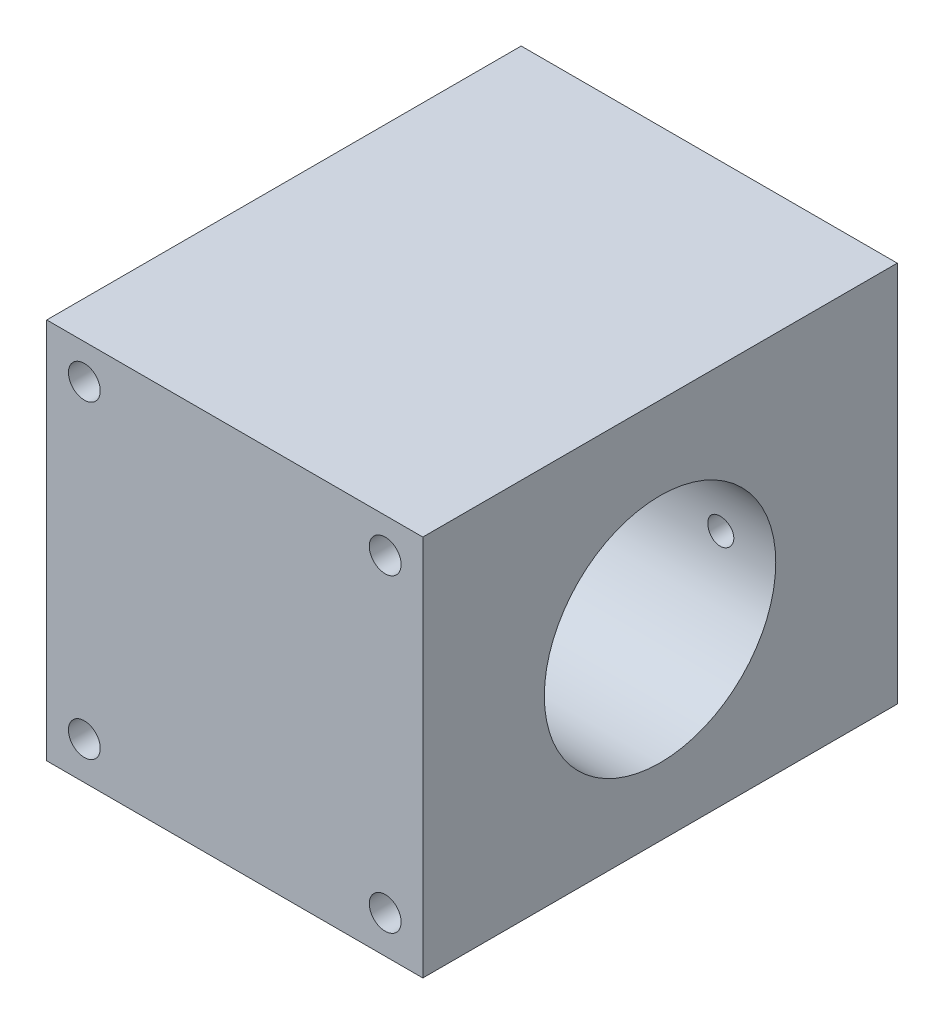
ISO-10303-21;
HEADER;
FILE_DESCRIPTION(('STEP AP214'),'2;1');
FILE_NAME('part.step','',(''),(''),'','','');
FILE_SCHEMA(('AUTOMOTIVE_DESIGN { 1 0 10303 214 1 1 1 1 }'));
ENDSEC;
DATA;
#1=APPLICATION_CONTEXT('core data for automotive mechanical design processes');
#2=APPLICATION_PROTOCOL_DEFINITION('international standard','automotive_design',2000,#1);
#3=PRODUCT_CONTEXT('',#1,'mechanical');
#4=PRODUCT('Part','Part','',(#3));
#5=PRODUCT_RELATED_PRODUCT_CATEGORY('part','',(#4));
#6=PRODUCT_DEFINITION_FORMATION('','',#4);
#7=PRODUCT_DEFINITION_CONTEXT('part definition',#1,'design');
#8=PRODUCT_DEFINITION('design','',#6,#7);
#9=PRODUCT_DEFINITION_SHAPE('','',#8);
#10=(LENGTH_UNIT() NAMED_UNIT(*) SI_UNIT(.MILLI.,.METRE.));
#11=(NAMED_UNIT(*) PLANE_ANGLE_UNIT() SI_UNIT($,.RADIAN.));
#12=(NAMED_UNIT(*) SI_UNIT($,.STERADIAN.) SOLID_ANGLE_UNIT());
#13=UNCERTAINTY_MEASURE_WITH_UNIT(LENGTH_MEASURE(1.E-05),#10,'distance_accuracy_value','');
#14=(GEOMETRIC_REPRESENTATION_CONTEXT(3) GLOBAL_UNCERTAINTY_ASSIGNED_CONTEXT((#13)) GLOBAL_UNIT_ASSIGNED_CONTEXT((#10,
#11,#12)) REPRESENTATION_CONTEXT('',''));
#15=CARTESIAN_POINT('',(0.,0.,0.));
#16=DIRECTION('',(0.,0.,1.));
#17=DIRECTION('',(1.,0.,0.));
#18=AXIS2_PLACEMENT_3D('',#15,#16,#17);
#19=CARTESIAN_POINT('',(0.,0.,82.));
#20=DIRECTION('',(1.,0.,0.));
#21=DIRECTION('',(0.,0.,-1.));
#22=AXIS2_PLACEMENT_3D('',#19,#20,#21);
#23=PLANE('',#22);
#24=CARTESIAN_POINT('',(0.,31.7,41.));
#25=DIRECTION('',(1.,0.,0.));
#26=DIRECTION('',(0.,0.,-1.));
#27=AXIS2_PLACEMENT_3D('',#24,#25,#26);
#28=CIRCLE('',#27,20.);
#29=CARTESIAN_POINT('',(0.,31.7,21.));
#30=VERTEX_POINT('',#29);
#31=EDGE_CURVE('E1577',#30,#30,#28,.T.);
#32=ORIENTED_EDGE('',*,*,#31,.T.);
#33=EDGE_LOOP('',(#32));
#34=FACE_BOUND('',#33,.T.);
#35=DIRECTION('',(0.,-1.,0.));
#36=VECTOR('',#35,1.);
#37=CARTESIAN_POINT('',(0.,0.,0.));
#38=LINE('',#37,#36);
#39=CARTESIAN_POINT('',(0.,66.,0.));
#40=VERTEX_POINT('',#39);
#41=CARTESIAN_POINT('',(0.,0.,0.));
#42=VERTEX_POINT('',#41);
#43=EDGE_CURVE('E790',#40,#42,#38,.T.);
#44=ORIENTED_EDGE('',*,*,#43,.T.);
#45=DIRECTION('',(0.,0.,-1.));
#46=VECTOR('',#45,1.);
#47=CARTESIAN_POINT('',(0.,0.,82.));
#48=LINE('',#47,#46);
#49=CARTESIAN_POINT('',(0.,0.,82.));
#50=VERTEX_POINT('',#49);
#51=EDGE_CURVE('E11',#50,#42,#48,.T.);
#52=ORIENTED_EDGE('',*,*,#51,.F.);
#53=DIRECTION('',(0.,-1.,0.));
#54=VECTOR('',#53,1.);
#55=CARTESIAN_POINT('',(0.,0.,82.));
#56=LINE('',#55,#54);
#57=CARTESIAN_POINT('',(0.,66.,82.));
#58=VERTEX_POINT('',#57);
#59=EDGE_CURVE('E791',#58,#50,#56,.T.);
#60=ORIENTED_EDGE('',*,*,#59,.F.);
#61=DIRECTION('',(0.,0.,-1.));
#62=VECTOR('',#61,1.);
#63=CARTESIAN_POINT('',(0.,66.,82.));
#64=LINE('',#63,#62);
#65=EDGE_CURVE('E801',#58,#40,#64,.T.);
#66=ORIENTED_EDGE('',*,*,#65,.T.);
#67=EDGE_LOOP('',(#44,#52,#60,#66));
#68=FACE_BOUND('',#67,.T.);
#69=ADVANCED_FACE('F37',(#34,#68),#23,.F.);
#70=CARTESIAN_POINT('',(0.,0.,82.));
#71=DIRECTION('',(0.,1.,0.));
#72=DIRECTION('',(0.,0.,1.));
#73=AXIS2_PLACEMENT_3D('',#70,#71,#72);
#74=PLANE('',#73);
#75=DIRECTION('',(1.,0.,0.));
#76=VECTOR('',#75,1.);
#77=CARTESIAN_POINT('',(0.,0.,0.));
#78=LINE('',#77,#76);
#79=CARTESIAN_POINT('',(65.,0.,0.));
#80=VERTEX_POINT('',#79);
#81=EDGE_CURVE('E804',#42,#80,#78,.T.);
#82=ORIENTED_EDGE('',*,*,#81,.T.);
#83=DIRECTION('',(0.,0.,-1.));
#84=VECTOR('',#83,1.);
#85=CARTESIAN_POINT('',(65.,0.,82.));
#86=LINE('',#85,#84);
#87=CARTESIAN_POINT('',(65.,0.,82.));
#88=VERTEX_POINT('',#87);
#89=EDGE_CURVE('E49',#88,#80,#86,.T.);
#90=ORIENTED_EDGE('',*,*,#89,.F.);
#91=DIRECTION('',(1.,0.,0.));
#92=VECTOR('',#91,1.);
#93=CARTESIAN_POINT('',(0.,0.,82.));
#94=LINE('',#93,#92);
#95=EDGE_CURVE('E794',#50,#88,#94,.T.);
#96=ORIENTED_EDGE('',*,*,#95,.F.);
#97=ORIENTED_EDGE('',*,*,#51,.T.);
#98=EDGE_LOOP('',(#82,#90,#96,#97));
#99=FACE_BOUND('',#98,.T.);
#100=ADVANCED_FACE('F835',(#99),#74,.F.);
#101=CARTESIAN_POINT('',(65.,0.,82.));
#102=DIRECTION('',(-1.,0.,0.));
#103=DIRECTION('',(0.,0.,1.));
#104=AXIS2_PLACEMENT_3D('',#101,#102,#103);
#105=PLANE('',#104);
#106=CARTESIAN_POINT('',(65.,31.7,41.));
#107=DIRECTION('',(1.,0.,0.));
#108=DIRECTION('',(0.,0.,-1.));
#109=AXIS2_PLACEMENT_3D('',#106,#107,#108);
#110=CIRCLE('',#109,20.);
#111=CARTESIAN_POINT('',(65.,31.7,21.));
#112=VERTEX_POINT('',#111);
#113=EDGE_CURVE('E1581',#112,#112,#110,.T.);
#114=ORIENTED_EDGE('',*,*,#113,.F.);
#115=EDGE_LOOP('',(#114));
#116=FACE_BOUND('',#115,.T.);
#117=DIRECTION('',(0.,1.,0.));
#118=VECTOR('',#117,1.);
#119=CARTESIAN_POINT('',(65.,0.,0.));
#120=LINE('',#119,#118);
#121=CARTESIAN_POINT('',(65.,66.,0.));
#122=VERTEX_POINT('',#121);
#123=EDGE_CURVE('E806',#80,#122,#120,.T.);
#124=ORIENTED_EDGE('',*,*,#123,.T.);
#125=DIRECTION('',(0.,0.,-1.));
#126=VECTOR('',#125,1.);
#127=CARTESIAN_POINT('',(65.,66.,82.));
#128=LINE('',#127,#126);
#129=CARTESIAN_POINT('',(65.,66.,82.));
#130=VERTEX_POINT('',#129);
#131=EDGE_CURVE('E811',#130,#122,#128,.T.);
#132=ORIENTED_EDGE('',*,*,#131,.F.);
#133=DIRECTION('',(0.,1.,0.));
#134=VECTOR('',#133,1.);
#135=CARTESIAN_POINT('',(65.,0.,82.));
#136=LINE('',#135,#134);
#137=EDGE_CURVE('E797',#88,#130,#136,.T.);
#138=ORIENTED_EDGE('',*,*,#137,.F.);
#139=ORIENTED_EDGE('',*,*,#89,.T.);
#140=EDGE_LOOP('',(#124,#132,#138,#139));
#141=FACE_BOUND('',#140,.T.);
#142=ADVANCED_FACE('F819',(#116,#141),#105,.F.);
#143=CARTESIAN_POINT('',(0.,66.,82.));
#144=DIRECTION('',(0.,-1.,0.));
#145=DIRECTION('',(0.,0.,-1.));
#146=AXIS2_PLACEMENT_3D('',#143,#144,#145);
#147=PLANE('',#146);
#148=DIRECTION('',(-1.,0.,0.));
#149=VECTOR('',#148,1.);
#150=CARTESIAN_POINT('',(0.,66.,0.));
#151=LINE('',#150,#149);
#152=EDGE_CURVE('E795',#122,#40,#151,.T.);
#153=ORIENTED_EDGE('',*,*,#152,.T.);
#154=ORIENTED_EDGE('',*,*,#65,.F.);
#155=DIRECTION('',(-1.,0.,0.));
#156=VECTOR('',#155,1.);
#157=CARTESIAN_POINT('',(0.,66.,82.));
#158=LINE('',#157,#156);
#159=EDGE_CURVE('E799',#130,#58,#158,.T.);
#160=ORIENTED_EDGE('',*,*,#159,.F.);
#161=ORIENTED_EDGE('',*,*,#131,.T.);
#162=EDGE_LOOP('',(#153,#154,#160,#161));
#163=FACE_BOUND('',#162,.T.);
#164=ADVANCED_FACE('F828',(#163),#147,.F.);
#165=CARTESIAN_POINT('',(0.,0.,82.));
#166=DIRECTION('',(0.,0.,-1.));
#167=DIRECTION('',(-1.,0.,0.));
#168=AXIS2_PLACEMENT_3D('',#165,#166,#167);
#169=PLANE('',#168);
#170=CARTESIAN_POINT('',(58.5,6.49999999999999,82.));
#171=DIRECTION('',(0.,0.,-1.));
#172=DIRECTION('',(-1.,0.,0.));
#173=AXIS2_PLACEMENT_3D('',#170,#171,#172);
#174=CIRCLE('',#173,2.74999999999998);
#175=CARTESIAN_POINT('',(55.75,6.49999999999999,82.));
#176=VERTEX_POINT('',#175);
#177=EDGE_CURVE('E751',#176,#176,#174,.T.);
#178=ORIENTED_EDGE('',*,*,#177,.T.);
#179=EDGE_LOOP('',(#178));
#180=FACE_BOUND('',#179,.T.);
#181=CARTESIAN_POINT('',(6.50000000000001,6.49999999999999,82.));
#182=DIRECTION('',(0.,0.,-1.));
#183=DIRECTION('',(-1.,0.,0.));
#184=AXIS2_PLACEMENT_3D('',#181,#182,#183);
#185=CIRCLE('',#184,2.74999999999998);
#186=CARTESIAN_POINT('',(3.75000000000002,6.49999999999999,82.));
#187=VERTEX_POINT('',#186);
#188=EDGE_CURVE('E763',#187,#187,#185,.T.);
#189=ORIENTED_EDGE('',*,*,#188,.T.);
#190=EDGE_LOOP('',(#189));
#191=FACE_BOUND('',#190,.T.);
#192=CARTESIAN_POINT('',(58.5,60.,82.));
#193=DIRECTION('',(0.,0.,-1.));
#194=DIRECTION('',(-1.,0.,0.));
#195=AXIS2_PLACEMENT_3D('',#192,#193,#194);
#196=CIRCLE('',#195,2.74999999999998);
#197=CARTESIAN_POINT('',(55.75,60.,82.));
#198=VERTEX_POINT('',#197);
#199=EDGE_CURVE('E775',#198,#198,#196,.T.);
#200=ORIENTED_EDGE('',*,*,#199,.T.);
#201=EDGE_LOOP('',(#200));
#202=FACE_BOUND('',#201,.T.);
#203=CARTESIAN_POINT('',(6.50000000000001,60.,82.));
#204=DIRECTION('',(0.,0.,-1.));
#205=DIRECTION('',(-1.,0.,0.));
#206=AXIS2_PLACEMENT_3D('',#203,#204,#205);
#207=CIRCLE('',#206,2.74999999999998);
#208=CARTESIAN_POINT('',(3.75000000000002,60.,82.));
#209=VERTEX_POINT('',#208);
#210=EDGE_CURVE('E787',#209,#209,#207,.T.);
#211=ORIENTED_EDGE('',*,*,#210,.T.);
#212=EDGE_LOOP('',(#211));
#213=FACE_BOUND('',#212,.T.);
#214=ORIENTED_EDGE('',*,*,#59,.T.);
#215=ORIENTED_EDGE('',*,*,#95,.T.);
#216=ORIENTED_EDGE('',*,*,#137,.T.);
#217=ORIENTED_EDGE('',*,*,#159,.T.);
#218=EDGE_LOOP('',(#214,#215,#216,#217));
#219=FACE_BOUND('',#218,.T.);
#220=ADVANCED_FACE('F834',(#180,#191,#202,#213,#219),#169,.F.);
#221=CARTESIAN_POINT('',(0.,0.,0.));
#222=DIRECTION('',(0.,0.,-1.));
#223=DIRECTION('',(-1.,0.,0.));
#224=AXIS2_PLACEMENT_3D('',#221,#222,#223);
#225=PLANE('',#224);
#226=DIRECTION('',(0.625725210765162,0.780043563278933,0.));
#227=VECTOR('',#226,1.);
#228=CARTESIAN_POINT('',(33.8246579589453,50.0941605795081,0.));
#229=LINE('',#228,#227);
#230=CARTESIAN_POINT('',(31.0830040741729,46.6763512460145,0.));
#231=VERTEX_POINT('',#230);
#232=CARTESIAN_POINT('',(33.8246579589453,50.0941605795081,0.));
#233=VERTEX_POINT('',#232);
#234=EDGE_CURVE('E56',#231,#233,#229,.T.);
#235=ORIENTED_EDGE('',*,*,#234,.F.);
#236=DIRECTION('',(0.625732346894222,0.780037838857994,0.));
#237=VECTOR('',#236,1.);
#238=CARTESIAN_POINT('',(31.0830040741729,46.6763512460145,0.));
#239=LINE('',#238,#237);
#240=CARTESIAN_POINT('',(28.9157236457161,43.9746198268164,0.));
#241=VERTEX_POINT('',#240);
#242=EDGE_CURVE('E1663',#241,#231,#239,.T.);
#243=ORIENTED_EDGE('',*,*,#242,.F.);
#244=DIRECTION('',(-0.278239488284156,0.960511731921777,0.));
#245=VECTOR('',#244,1.);
#246=CARTESIAN_POINT('',(28.9157236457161,43.9746198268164,0.));
#247=LINE('',#246,#245);
#248=CARTESIAN_POINT('',(29.866836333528,40.6912796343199,0.));
#249=VERTEX_POINT('',#248);
#250=EDGE_CURVE('E1696',#249,#241,#247,.T.);
#251=ORIENTED_EDGE('',*,*,#250,.F.);
#252=DIRECTION('',(-1.,0.,0.));
#253=VECTOR('',#252,1.);
#254=CARTESIAN_POINT('',(29.866836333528,40.6912796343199,0.));
#255=LINE('',#254,#253);
#256=CARTESIAN_POINT('',(35.133163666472,40.6912796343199,0.));
#257=VERTEX_POINT('',#256);
#258=EDGE_CURVE('E1693',#257,#249,#255,.T.);
#259=ORIENTED_EDGE('',*,*,#258,.F.);
#260=DIRECTION('',(0.273552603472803,-0.961857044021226,0.));
#261=VECTOR('',#260,1.);
#262=CARTESIAN_POINT('',(35.133163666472,40.6912796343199,0.));
#263=LINE('',#262,#261);
#264=CARTESIAN_POINT('',(34.0307418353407,44.5675805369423,0.));
#265=VERTEX_POINT('',#264);
#266=EDGE_CURVE('E1690',#265,#257,#263,.T.);
#267=ORIENTED_EDGE('',*,*,#266,.F.);
#268=DIRECTION('',(-0.605226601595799,-0.796053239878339,0.));
#269=VECTOR('',#268,1.);
#270=CARTESIAN_POINT('',(34.0307418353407,44.5675805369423,0.));
#271=LINE('',#270,#269);
#272=CARTESIAN_POINT('',(38.2325126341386,50.0941605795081,0.));
#273=VERTEX_POINT('',#272);
#274=EDGE_CURVE('E1687',#273,#265,#271,.T.);
#275=ORIENTED_EDGE('',*,*,#274,.F.);
#276=DIRECTION('',(1.,0.,0.));
#277=VECTOR('',#276,1.);
#278=CARTESIAN_POINT('',(38.2325126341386,50.0941605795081,0.));
#279=LINE('',#278,#277);
#280=EDGE_CURVE('E1683',#233,#273,#279,.T.);
#281=ORIENTED_EDGE('',*,*,#280,.F.);
#282=EDGE_LOOP('',(#235,#243,#251,#259,#267,#275,#281));
#283=FACE_BOUND('',#282,.T.);
#284=DIRECTION('',(-0.436182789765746,-0.899858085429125,0.));
#285=VECTOR('',#284,1.);
#286=CARTESIAN_POINT('',(14.8619511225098,40.6730711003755,0.));
#287=LINE('',#286,#285);
#288=CARTESIAN_POINT('',(16.1649715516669,43.361241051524,0.));
#289=VERTEX_POINT('',#288);
#290=CARTESIAN_POINT('',(14.8619511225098,40.6730711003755,0.));
#291=VERTEX_POINT('',#290);
#292=EDGE_CURVE('E64',#289,#291,#287,.T.);
#293=ORIENTED_EDGE('',*,*,#292,.F.);
#294=DIRECTION('',(0.823965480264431,-0.566639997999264,0.));
#295=VECTOR('',#294,1.);
#296=CARTESIAN_POINT('',(16.1649715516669,43.361241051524,0.));
#297=LINE('',#296,#295);
#298=CARTESIAN_POINT('',(12.6898696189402,45.7510641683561,0.));
#299=VERTEX_POINT('',#298);
#300=EDGE_CURVE('E1719',#299,#289,#297,.T.);
#301=ORIENTED_EDGE('',*,*,#300,.F.);
#302=DIRECTION('',(0.522587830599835,0.852585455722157,0.));
#303=VECTOR('',#302,1.);
#304=CARTESIAN_POINT('',(12.6898696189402,45.7510641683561,0.));
#305=LINE('',#304,#303);
#306=CARTESIAN_POINT('',(9.57734012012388,40.6730711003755,0.));
#307=VERTEX_POINT('',#306);
#308=EDGE_CURVE('E1733',#307,#299,#305,.T.);
#309=ORIENTED_EDGE('',*,*,#308,.F.);
#310=DIRECTION('',(-1.,0.,0.));
#311=VECTOR('',#310,1.);
#312=CARTESIAN_POINT('',(9.57734012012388,40.6730711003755,0.));
#313=LINE('',#312,#311);
#314=EDGE_CURVE('E1730',#291,#307,#313,.T.);
#315=ORIENTED_EDGE('',*,*,#314,.F.);
#316=EDGE_LOOP('',(#293,#301,#309,#315));
#317=FACE_BOUND('',#316,.T.);
#318=CARTESIAN_POINT('',(20.097117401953,41.5341326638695,0.));
#319=CARTESIAN_POINT('',(15.8434640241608,44.0409783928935,0.));
#320=CARTESIAN_POINT('',(11.609771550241,47.4601593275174,0.));
#321=CARTESIAN_POINT('',(7.24679032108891,50.0941605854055,0.));
#322=B_SPLINE_CURVE_WITH_KNOTS('',3,(#318,#319,#320,#321),.UNSPECIFIED.,.F.,.F.,(4,4),(0.875,
1.),.UNSPECIFIED.);
#323=CARTESIAN_POINT('',(20.097117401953,41.5341326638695,0.));
#324=VERTEX_POINT('',#323);
#325=CARTESIAN_POINT('',(7.2467903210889,50.0941605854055,0.));
#326=VERTEX_POINT('',#325);
#327=EDGE_CURVE('E389',#324,#326,#322,.T.);
#328=ORIENTED_EDGE('',*,*,#327,.F.);
#329=DIRECTION('',(-0.278635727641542,0.960396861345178,0.));
#330=VECTOR('',#329,1.);
#331=CARTESIAN_POINT('',(20.097117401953,41.5341326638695,0.));
#332=LINE('',#331,#330);
#333=CARTESIAN_POINT('',(20.3469334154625,40.6730711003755,0.));
#334=VERTEX_POINT('',#333);
#335=EDGE_CURVE('E407',#334,#324,#332,.T.);
#336=ORIENTED_EDGE('',*,*,#335,.F.);
#337=DIRECTION('',(-1.,0.,0.));
#338=VECTOR('',#337,1.);
#339=CARTESIAN_POINT('',(20.3469334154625,40.6730711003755,0.));
#340=LINE('',#339,#338);
#341=CARTESIAN_POINT('',(25.3217701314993,40.6730711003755,0.));
#342=VERTEX_POINT('',#341);
#343=EDGE_CURVE('E410',#342,#334,#340,.T.);
#344=ORIENTED_EDGE('',*,*,#343,.F.);
#345=DIRECTION('',(0.278468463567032,-0.960445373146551,0.));
#346=VECTOR('',#345,1.);
#347=CARTESIAN_POINT('',(25.3217701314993,40.6730711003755,0.));
#348=LINE('',#347,#346);
#349=CARTESIAN_POINT('',(22.5902495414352,50.0941605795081,0.));
#350=VERTEX_POINT('',#349);
#351=EDGE_CURVE('E1609',#350,#342,#348,.T.);
#352=ORIENTED_EDGE('',*,*,#351,.F.);
#353=DIRECTION('',(1.,0.,0.));
#354=VECTOR('',#353,1.);
#355=CARTESIAN_POINT('',(22.5902495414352,50.0941605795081,0.));
#356=LINE('',#355,#354);
#357=CARTESIAN_POINT('',(17.5972049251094,50.0941605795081,0.));
#358=VERTEX_POINT('',#357);
#359=EDGE_CURVE('E1606',#358,#350,#356,.T.);
#360=ORIENTED_EDGE('',*,*,#359,.F.);
#361=DIRECTION('',(-0.281537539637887,0.959550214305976,0.));
#362=VECTOR('',#361,1.);
#363=CARTESIAN_POINT('',(17.5972049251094,50.0941605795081,0.));
#364=LINE('',#363,#362);
#365=CARTESIAN_POINT('',(18.8643412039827,45.7754438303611,0.));
#366=VERTEX_POINT('',#365);
#367=EDGE_CURVE('E1603',#366,#358,#364,.T.);
#368=ORIENTED_EDGE('',*,*,#367,.F.);
#369=DIRECTION('',(0.839276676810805,-0.543704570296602,0.));
#370=VECTOR('',#369,1.);
#371=CARTESIAN_POINT('',(18.8643412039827,45.7754438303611,0.));
#372=LINE('',#371,#370);
#373=CARTESIAN_POINT('',(12.1978564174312,50.0941605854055,0.));
#374=VERTEX_POINT('',#373);
#375=EDGE_CURVE('E1591',#374,#366,#372,.T.);
#376=ORIENTED_EDGE('',*,*,#375,.F.);
#377=DIRECTION('',(1.,0.,0.));
#378=VECTOR('',#377,1.);
#379=CARTESIAN_POINT('',(12.1978564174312,50.0941605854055,0.));
#380=LINE('',#379,#378);
#381=EDGE_CURVE('E1584',#326,#374,#380,.T.);
#382=ORIENTED_EDGE('',*,*,#381,.F.);
#383=EDGE_LOOP('',(#328,#336,#344,#352,#360,#368,#376,#382));
#384=FACE_BOUND('',#383,.T.);
#385=DIRECTION('',(0.69027468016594,-0.723547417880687,0.));
#386=VECTOR('',#385,1.);
#387=CARTESIAN_POINT('',(30.8045427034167,46.9682219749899,0.));
#388=LINE('',#387,#386);
#389=CARTESIAN_POINT('',(26.6903113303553,51.2807682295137,0.));
#390=VERTEX_POINT('',#389);
#391=CARTESIAN_POINT('',(30.8045427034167,46.9682219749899,0.));
#392=VERTEX_POINT('',#391);
#393=EDGE_CURVE('E1616',#390,#392,#388,.T.);
#394=ORIENTED_EDGE('',*,*,#393,.F.);
#395=DIRECTION('',(1.,0.,0.));
#396=VECTOR('',#395,1.);
#397=CARTESIAN_POINT('',(26.6903113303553,51.2807682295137,0.));
#398=LINE('',#397,#396);
#399=CARTESIAN_POINT('',(22.5586738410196,51.2807682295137,0.));
#400=VERTEX_POINT('',#399);
#401=EDGE_CURVE('E1632',#400,#390,#398,.T.);
#402=ORIENTED_EDGE('',*,*,#401,.F.);
#403=DIRECTION('',(-0.67301733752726,0.739626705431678,0.));
#404=VECTOR('',#403,1.);
#405=CARTESIAN_POINT('',(22.5586738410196,51.2807682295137,0.));
#406=LINE('',#405,#404);
#407=CARTESIAN_POINT('',(28.7797305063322,44.4440058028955,0.));
#408=VERTEX_POINT('',#407);
#409=EDGE_CURVE('E1646',#408,#400,#406,.T.);
#410=ORIENTED_EDGE('',*,*,#409,.F.);
#411=DIRECTION('',(-0.625719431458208,-0.780048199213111,0.));
#412=VECTOR('',#411,1.);
#413=CARTESIAN_POINT('',(28.7797305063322,44.4440058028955,0.));
#414=LINE('',#413,#412);
#415=EDGE_CURVE('E1643',#392,#408,#414,.T.);
#416=ORIENTED_EDGE('',*,*,#415,.F.);
#417=EDGE_LOOP('',(#394,#402,#410,#416));
#418=FACE_BOUND('',#417,.T.);
#419=DIRECTION('',(1.,0.,0.));
#420=VECTOR('',#419,1.);
#421=CARTESIAN_POINT('',(17.5442547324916,53.4370020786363,0.));
#422=LINE('',#421,#420);
#423=CARTESIAN_POINT('',(17.5442547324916,53.4370020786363,0.));
#424=VERTEX_POINT('',#423);
#425=CARTESIAN_POINT('',(20.4992308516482,53.4370020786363,0.));
#426=VERTEX_POINT('',#425);
#427=EDGE_CURVE('E1771',#424,#426,#422,.T.);
#428=ORIENTED_EDGE('',*,*,#427,.F.);
#429=DIRECTION('',(-0.690267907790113,0.723553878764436,0.));
#430=VECTOR('',#429,1.);
#431=CARTESIAN_POINT('',(19.601294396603,51.2807682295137,0.));
#432=LINE('',#431,#430);
#433=CARTESIAN_POINT('',(19.601294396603,51.2807682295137,0.));
#434=VERTEX_POINT('',#433);
#435=EDGE_CURVE('E1812',#434,#424,#432,.T.);
#436=ORIENTED_EDGE('',*,*,#435,.F.);
#437=DIRECTION('',(-1.,0.,0.));
#438=VECTOR('',#437,1.);
#439=CARTESIAN_POINT('',(22.4596681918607,51.2807682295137,0.));
#440=LINE('',#439,#438);
#441=CARTESIAN_POINT('',(22.4596681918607,51.2807682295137,0.));
#442=VERTEX_POINT('',#441);
#443=EDGE_CURVE('E1831',#442,#434,#440,.T.);
#444=ORIENTED_EDGE('',*,*,#443,.F.);
#445=DIRECTION('',(-0.304489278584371,-0.952515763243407,0.));
#446=VECTOR('',#445,1.);
#447=CARTESIAN_POINT('',(22.4844951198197,51.3584328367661,0.));
#448=LINE('',#447,#446);
#449=CARTESIAN_POINT('',(22.4844951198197,51.3584328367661,0.));
#450=VERTEX_POINT('',#449);
#451=EDGE_CURVE('E1828',#450,#442,#448,.T.);
#452=ORIENTED_EDGE('',*,*,#451,.F.);
#453=DIRECTION('',(0.690689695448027,-0.723151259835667,0.));
#454=VECTOR('',#453,1.);
#455=CARTESIAN_POINT('',(20.4992308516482,53.4370020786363,0.));
#456=LINE('',#455,#454);
#457=EDGE_CURVE('E1825',#426,#450,#456,.T.);
#458=ORIENTED_EDGE('',*,*,#457,.F.);
#459=EDGE_LOOP('',(#428,#436,#444,#452,#458));
#460=FACE_BOUND('',#459,.T.);
#461=DIRECTION('',(-0.69024242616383,0.723578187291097,0.));
#462=VECTOR('',#461,1.);
#463=CARTESIAN_POINT('',(21.0564597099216,53.6409542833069,0.));
#464=LINE('',#463,#462);
#465=CARTESIAN_POINT('',(21.0564597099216,53.6409542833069,0.));
#466=VERTEX_POINT('',#465);
#467=CARTESIAN_POINT('',(20.027939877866,54.7191472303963,0.));
#468=VERTEX_POINT('',#467);
#469=EDGE_CURVE('E1758',#466,#468,#464,.T.);
#470=ORIENTED_EDGE('',*,*,#469,.F.);
#471=DIRECTION('',(-1.,0.,0.));
#472=VECTOR('',#471,1.);
#473=CARTESIAN_POINT('',(22.5340232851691,53.6409542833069,0.));
#474=LINE('',#473,#472);
#475=CARTESIAN_POINT('',(22.5340232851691,53.6409542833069,0.));
#476=VERTEX_POINT('',#475);
#477=EDGE_CURVE('E1748',#476,#466,#474,.T.);
#478=ORIENTED_EDGE('',*,*,#477,.F.);
#479=DIRECTION('',(0.690242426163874,-0.723578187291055,0.));
#480=VECTOR('',#479,1.);
#481=CARTESIAN_POINT('',(21.5055034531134,54.7191472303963,0.));
#482=LINE('',#481,#480);
#483=CARTESIAN_POINT('',(21.5055034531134,54.7191472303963,0.));
#484=VERTEX_POINT('',#483);
#485=EDGE_CURVE('E1764',#484,#476,#482,.T.);
#486=ORIENTED_EDGE('',*,*,#485,.F.);
#487=DIRECTION('',(1.,0.,0.));
#488=VECTOR('',#487,1.);
#489=CARTESIAN_POINT('',(20.027939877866,54.7191472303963,0.));
#490=LINE('',#489,#488);
#491=EDGE_CURVE('E1760',#468,#484,#490,.T.);
#492=ORIENTED_EDGE('',*,*,#491,.F.);
#493=EDGE_LOOP('',(#470,#478,#486,#492));
#494=FACE_BOUND('',#493,.T.);
#495=DIRECTION('',(-0.690240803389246,0.723579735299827,0.));
#496=VECTOR('',#495,1.);
#497=CARTESIAN_POINT('',(24.3844448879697,51.9523532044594,0.));
#498=LINE('',#497,#496);
#499=CARTESIAN_POINT('',(24.3844448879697,51.9523532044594,0.));
#500=VERTEX_POINT('',#499);
#501=CARTESIAN_POINT('',(23.1746012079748,53.2206328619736,0.));
#502=VERTEX_POINT('',#501);
#503=EDGE_CURVE('E1703',#500,#502,#498,.T.);
#504=ORIENTED_EDGE('',*,*,#503,.F.);
#505=DIRECTION('',(-1.,0.,0.));
#506=VECTOR('',#505,1.);
#507=CARTESIAN_POINT('',(26.1224920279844,51.9523532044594,0.));
#508=LINE('',#507,#506);
#509=CARTESIAN_POINT('',(26.1224920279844,51.9523532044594,0.));
#510=VERTEX_POINT('',#509);
#511=EDGE_CURVE('E1782',#510,#500,#508,.T.);
#512=ORIENTED_EDGE('',*,*,#511,.F.);
#513=DIRECTION('',(0.690263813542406,-0.723557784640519,0.));
#514=VECTOR('',#513,1.);
#515=CARTESIAN_POINT('',(24.9125713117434,53.2206328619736,0.));
#516=LINE('',#515,#514);
#517=CARTESIAN_POINT('',(24.9125713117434,53.2206328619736,0.));
#518=VERTEX_POINT('',#517);
#519=EDGE_CURVE('E1796',#518,#510,#516,.T.);
#520=ORIENTED_EDGE('',*,*,#519,.F.);
#521=DIRECTION('',(1.,0.,0.));
#522=VECTOR('',#521,1.);
#523=CARTESIAN_POINT('',(23.1746012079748,53.2206328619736,0.));
#524=LINE('',#523,#522);
#525=EDGE_CURVE('E1793',#502,#518,#524,.T.);
#526=ORIENTED_EDGE('',*,*,#525,.F.);
#527=EDGE_LOOP('',(#504,#512,#520,#526));
#528=FACE_BOUND('',#527,.T.);
#529=CARTESIAN_POINT('',(40.9745465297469,44.627387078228,0.));
#530=CARTESIAN_POINT('',(38.4609201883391,45.1133055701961,0.));
#531=CARTESIAN_POINT('',(37.2225060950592,46.03051672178,0.));
#532=CARTESIAN_POINT('',(37.2593042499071,47.37902053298,0.));
#533=B_SPLINE_CURVE_WITH_KNOTS('',3,(#529,#530,#531,#532),.UNSPECIFIED.,.F.,.F.,(4,4),
(0.923076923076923,1.),.UNSPECIFIED.);
#534=CARTESIAN_POINT('',(40.9745465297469,44.6273870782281,0.));
#535=VERTEX_POINT('',#534);
#536=CARTESIAN_POINT('',(37.2593042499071,47.37902053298,0.));
#537=VERTEX_POINT('',#536);
#538=EDGE_CURVE('E623',#535,#537,#533,.T.);
#539=ORIENTED_EDGE('',*,*,#538,.F.);
#540=DIRECTION('',(0.466422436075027,0.884562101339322,0.));
#541=VECTOR('',#540,1.);
#542=CARTESIAN_POINT('',(40.9745465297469,44.6273870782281,0.));
#543=LINE('',#542,#541);
#544=CARTESIAN_POINT('',(38.8990688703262,40.6912795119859,0.));
#545=VERTEX_POINT('',#544);
#546=EDGE_CURVE('E692',#545,#535,#543,.T.);
#547=ORIENTED_EDGE('',*,*,#546,.F.);
#548=DIRECTION('',(-1.,0.,0.));
#549=VECTOR('',#548,1.);
#550=CARTESIAN_POINT('',(38.8990688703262,40.6912795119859,0.));
#551=LINE('',#550,#549);
#552=CARTESIAN_POINT('',(44.2383068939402,40.6912795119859,0.));
#553=VERTEX_POINT('',#552);
#554=EDGE_CURVE('E689',#553,#545,#551,.T.);
#555=ORIENTED_EDGE('',*,*,#554,.F.);
#556=DIRECTION('',(-0.426227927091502,-0.904615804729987,0.));
#557=VECTOR('',#556,1.);
#558=CARTESIAN_POINT('',(44.2383068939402,40.6912795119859,0.));
#559=LINE('',#558,#557);
#560=CARTESIAN_POINT('',(45.6999827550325,43.7935048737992,0.));
#561=VERTEX_POINT('',#560);
#562=EDGE_CURVE('E686',#561,#553,#559,.T.);
#563=ORIENTED_EDGE('',*,*,#562,.F.);
#564=DIRECTION('',(-0.426211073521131,-0.904623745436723,0.));
#565=VECTOR('',#564,1.);
#566=CARTESIAN_POINT('',(45.6999827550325,43.7935048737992,0.));
#567=LINE('',#566,#565);
#568=CARTESIAN_POINT('',(46.8483850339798,46.230963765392,0.));
#569=VERTEX_POINT('',#568);
#570=EDGE_CURVE('E680',#569,#561,#567,.T.);
#571=ORIENTED_EDGE('',*,*,#570,.F.);
#572=CARTESIAN_POINT('',(42.5591524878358,47.2696926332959,0.));
#573=CARTESIAN_POINT('',(42.5250208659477,46.0196219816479,0.));
#574=CARTESIAN_POINT('',(45.8405879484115,46.230963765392,0.));
#575=CARTESIAN_POINT('',(46.8483850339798,46.230963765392,0.));
#576=B_SPLINE_CURVE_WITH_KNOTS('',3,(#572,#573,#574,#575),.UNSPECIFIED.,.F.,.F.,(4,4),
(0.230769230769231,0.307692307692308),.UNSPECIFIED.);
#577=CARTESIAN_POINT('',(42.5591524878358,47.2696926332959,0.));
#578=VERTEX_POINT('',#577);
#579=EDGE_CURVE('E672',#578,#569,#576,.T.);
#580=ORIENTED_EDGE('',*,*,#579,.F.);
#581=CARTESIAN_POINT('',(45.0425327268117,48.1261068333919,0.));
#582=CARTESIAN_POINT('',(43.4024625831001,48.1261068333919,0.));
#583=CARTESIAN_POINT('',(42.5746945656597,47.8406354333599,0.));
#584=CARTESIAN_POINT('',(42.5591524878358,47.2696926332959,0.));
#585=B_SPLINE_CURVE_WITH_KNOTS('',3,(#581,#582,#583,#584),.UNSPECIFIED.,.F.,.F.,(4,4),
(0.307692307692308,0.384615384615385),.UNSPECIFIED.);
#586=CARTESIAN_POINT('',(45.0425327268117,48.1261068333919,0.));
#587=VERTEX_POINT('',#586);
#588=EDGE_CURVE('E667',#587,#578,#585,.T.);
#589=ORIENTED_EDGE('',*,*,#588,.F.);
#590=DIRECTION('',(-1.,0.,0.));
#591=VECTOR('',#590,1.);
#592=CARTESIAN_POINT('',(45.0425327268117,48.1261068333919,0.));
#593=LINE('',#592,#591);
#594=CARTESIAN_POINT('',(46.919467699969,48.1261068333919,0.));
#595=VERTEX_POINT('',#594);
#596=EDGE_CURVE('E661',#595,#587,#593,.T.);
#597=ORIENTED_EDGE('',*,*,#596,.F.);
#598=CARTESIAN_POINT('',(49.1038153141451,40.6912796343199,0.));
#599=CARTESIAN_POINT('',(48.3749375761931,43.1693268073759,0.));
#600=CARTESIAN_POINT('',(47.660763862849,45.65217373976,0.));
#601=CARTESIAN_POINT('',(46.919467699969,48.1261068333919,0.));
#602=B_SPLINE_CURVE_WITH_KNOTS('',3,(#598,#599,#600,#601),.UNSPECIFIED.,.F.,.F.,(4,4),
(0.461538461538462,0.538461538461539),.UNSPECIFIED.);
#603=CARTESIAN_POINT('',(49.1038153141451,40.6912796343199,0.));
#604=VERTEX_POINT('',#603);
#605=EDGE_CURVE('E656',#604,#595,#602,.T.);
#606=ORIENTED_EDGE('',*,*,#605,.F.);
#607=DIRECTION('',(-1.,0.,0.));
#608=VECTOR('',#607,1.);
#609=CARTESIAN_POINT('',(49.1038153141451,40.6912796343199,0.));
#610=LINE('',#609,#608);
#611=CARTESIAN_POINT('',(54.2426061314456,40.6912796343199,0.));
#612=VERTEX_POINT('',#611);
#613=EDGE_CURVE('E653',#612,#604,#610,.T.);
#614=ORIENTED_EDGE('',*,*,#613,.F.);
#615=DIRECTION('',(0.280722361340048,-0.959789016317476,0.));
#616=VECTOR('',#615,1.);
#617=CARTESIAN_POINT('',(54.2426061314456,40.6912796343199,0.));
#618=LINE('',#617,#616);
#619=CARTESIAN_POINT('',(51.492419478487,50.0941605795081,0.));
#620=VERTEX_POINT('',#619);
#621=EDGE_CURVE('E650',#620,#612,#618,.T.);
#622=ORIENTED_EDGE('',*,*,#621,.F.);
#623=DIRECTION('',(1.,0.,0.));
#624=VECTOR('',#623,1.);
#625=CARTESIAN_POINT('',(51.492419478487,50.0941605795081,0.));
#626=LINE('',#625,#624);
#627=CARTESIAN_POINT('',(43.6202043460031,50.0941605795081,0.));
#628=VERTEX_POINT('',#627);
#629=EDGE_CURVE('E644',#628,#620,#626,.T.);
#630=ORIENTED_EDGE('',*,*,#629,.F.);
#631=CARTESIAN_POINT('',(38.8533576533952,49.3652828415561,0.));
#632=CARTESIAN_POINT('',(39.8930769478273,49.851201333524,0.));
#633=CARTESIAN_POINT('',(41.4821020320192,50.0941605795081,0.));
#634=CARTESIAN_POINT('',(43.6202043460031,50.0941605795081,0.));
#635=B_SPLINE_CURVE_WITH_KNOTS('',3,(#631,#632,#633,#634),.UNSPECIFIED.,.F.,.F.,(4,4),
(0.769230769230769,0.846153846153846),.UNSPECIFIED.);
#636=CARTESIAN_POINT('',(38.8533576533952,49.3652828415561,0.));
#637=VERTEX_POINT('',#636);
#638=EDGE_CURVE('E636',#637,#628,#635,.T.);
#639=ORIENTED_EDGE('',*,*,#638,.F.);
#640=CARTESIAN_POINT('',(37.2593042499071,47.37902053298,0.));
#641=CARTESIAN_POINT('',(37.282160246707,48.2172261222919,0.));
#642=CARTESIAN_POINT('',(37.8135621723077,48.879364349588,0.));
#643=CARTESIAN_POINT('',(38.8533576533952,49.3652828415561,0.));
#644=B_SPLINE_CURVE_WITH_KNOTS('',3,(#640,#641,#642,#643),.UNSPECIFIED.,.F.,.F.,(4,4),
(0.846153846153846,0.923076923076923),.UNSPECIFIED.);
#645=EDGE_CURVE('E627',#537,#637,#644,.T.);
#646=ORIENTED_EDGE('',*,*,#645,.F.);
#647=EDGE_LOOP('',(#539,#547,#555,#563,#571,#580,#589,#597,#606,#614,#622,#630,#639,#646));
#648=FACE_BOUND('',#647,.T.);
#649=CARTESIAN_POINT('',(55.5,31.7,0.));
#650=DIRECTION('',(0.,0.,-1.));
#651=DIRECTION('',(-1.,0.,0.));
#652=AXIS2_PLACEMENT_3D('',#649,#650,#651);
#653=CIRCLE('',#652,4.);
#654=CARTESIAN_POINT('',(51.5,31.7,0.));
#655=VERTEX_POINT('',#654);
#656=EDGE_CURVE('E698',#655,#655,#653,.T.);
#657=ORIENTED_EDGE('',*,*,#656,.F.);
#658=EDGE_LOOP('',(#657));
#659=FACE_BOUND('',#658,.T.);
#660=CARTESIAN_POINT('',(9.5,31.7,0.));
#661=DIRECTION('',(0.,0.,-1.));
#662=DIRECTION('',(-1.,0.,0.));
#663=AXIS2_PLACEMENT_3D('',#660,#661,#662);
#664=CIRCLE('',#663,4.);
#665=CARTESIAN_POINT('',(5.5,31.7,0.));
#666=VERTEX_POINT('',#665);
#667=EDGE_CURVE('E733',#666,#666,#664,.T.);
#668=ORIENTED_EDGE('',*,*,#667,.F.);
#669=EDGE_LOOP('',(#668));
#670=FACE_BOUND('',#669,.T.);
#671=CARTESIAN_POINT('',(58.5,6.49999999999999,0.));
#672=DIRECTION('',(0.,0.,-1.));
#673=DIRECTION('',(-1.,0.,0.));
#674=AXIS2_PLACEMENT_3D('',#671,#672,#673);
#675=CIRCLE('',#674,4.8);
#676=CARTESIAN_POINT('',(53.7,6.49999999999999,0.));
#677=VERTEX_POINT('',#676);
#678=EDGE_CURVE('E742',#677,#677,#675,.T.);
#679=ORIENTED_EDGE('',*,*,#678,.F.);
#680=EDGE_LOOP('',(#679));
#681=FACE_BOUND('',#680,.T.);
#682=CARTESIAN_POINT('',(6.50000000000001,6.49999999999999,0.));
#683=DIRECTION('',(0.,0.,-1.));
#684=DIRECTION('',(-1.,0.,0.));
#685=AXIS2_PLACEMENT_3D('',#682,#683,#684);
#686=CIRCLE('',#685,4.79999999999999);
#687=CARTESIAN_POINT('',(1.70000000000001,6.49999999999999,0.));
#688=VERTEX_POINT('',#687);
#689=EDGE_CURVE('E754',#688,#688,#686,.T.);
#690=ORIENTED_EDGE('',*,*,#689,.F.);
#691=EDGE_LOOP('',(#690));
#692=FACE_BOUND('',#691,.T.);
#693=CARTESIAN_POINT('',(58.5,60.,0.));
#694=DIRECTION('',(0.,0.,-1.));
#695=DIRECTION('',(-1.,0.,0.));
#696=AXIS2_PLACEMENT_3D('',#693,#694,#695);
#697=CIRCLE('',#696,4.8);
#698=CARTESIAN_POINT('',(53.7,60.,0.));
#699=VERTEX_POINT('',#698);
#700=EDGE_CURVE('E766',#699,#699,#697,.T.);
#701=ORIENTED_EDGE('',*,*,#700,.F.);
#702=EDGE_LOOP('',(#701));
#703=FACE_BOUND('',#702,.T.);
#704=CARTESIAN_POINT('',(6.50000000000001,60.,0.));
#705=DIRECTION('',(0.,0.,-1.));
#706=DIRECTION('',(-1.,0.,0.));
#707=AXIS2_PLACEMENT_3D('',#704,#705,#706);
#708=CIRCLE('',#707,4.79999999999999);
#709=CARTESIAN_POINT('',(1.70000000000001,60.,0.));
#710=VERTEX_POINT('',#709);
#711=EDGE_CURVE('E778',#710,#710,#708,.T.);
#712=ORIENTED_EDGE('',*,*,#711,.F.);
#713=EDGE_LOOP('',(#712));
#714=FACE_BOUND('',#713,.T.);
#715=ORIENTED_EDGE('',*,*,#43,.F.);
#716=ORIENTED_EDGE('',*,*,#152,.F.);
#717=ORIENTED_EDGE('',*,*,#123,.F.);
#718=ORIENTED_EDGE('',*,*,#81,.F.);
#719=EDGE_LOOP('',(#715,#716,#717,#718));
#720=FACE_BOUND('',#719,.T.);
#721=ADVANCED_FACE('F825',(#283,#317,#384,#418,#460,#494,#528,#648,#659,#670,#681,#692,#703,
#714,#720),#225,.T.);
#722=CARTESIAN_POINT('',(6.50000000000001,60.,0.));
#723=DIRECTION('',(0.,0.,-1.));
#724=DIRECTION('',(-1.,0.,0.));
#725=AXIS2_PLACEMENT_3D('',#722,#723,#724);
#726=CYLINDRICAL_SURFACE('',#725,2.74999999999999);
#727=ORIENTED_EDGE('',*,*,#210,.F.);
#728=EDGE_LOOP('',(#727));
#729=FACE_BOUND('',#728,.T.);
#730=CARTESIAN_POINT('',(6.50000000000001,60.,50.));
#731=DIRECTION('',(0.,0.,-1.));
#732=DIRECTION('',(-1.,0.,0.));
#733=AXIS2_PLACEMENT_3D('',#730,#731,#732);
#734=CIRCLE('',#733,2.74999999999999);
#735=CARTESIAN_POINT('',(3.75000000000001,60.,50.));
#736=VERTEX_POINT('',#735);
#737=EDGE_CURVE('E784',#736,#736,#734,.T.);
#738=ORIENTED_EDGE('',*,*,#737,.T.);
#739=EDGE_LOOP('',(#738));
#740=FACE_BOUND('',#739,.T.);
#741=ADVANCED_FACE('F849',(#729,#740),#726,.F.);
#742=CARTESIAN_POINT('',(9.25,60.,50.));
#743=DIRECTION('',(0.,0.,1.));
#744=DIRECTION('',(1.,0.,0.));
#745=AXIS2_PLACEMENT_3D('',#742,#743,#744);
#746=PLANE('',#745);
#747=ORIENTED_EDGE('',*,*,#737,.F.);
#748=EDGE_LOOP('',(#747));
#749=FACE_BOUND('',#748,.T.);
#750=CARTESIAN_POINT('',(6.50000000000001,60.,50.));
#751=DIRECTION('',(0.,0.,-1.));
#752=DIRECTION('',(-1.,0.,0.));
#753=AXIS2_PLACEMENT_3D('',#750,#751,#752);
#754=CIRCLE('',#753,4.79999999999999);
#755=CARTESIAN_POINT('',(1.70000000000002,60.,50.));
#756=VERTEX_POINT('',#755);
#757=EDGE_CURVE('E781',#756,#756,#754,.T.);
#758=ORIENTED_EDGE('',*,*,#757,.T.);
#759=EDGE_LOOP('',(#758));
#760=FACE_BOUND('',#759,.T.);
#761=ADVANCED_FACE('F856',(#749,#760),#746,.F.);
#762=CARTESIAN_POINT('',(6.50000000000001,60.,0.));
#763=DIRECTION('',(0.,0.,-1.));
#764=DIRECTION('',(-1.,0.,0.));
#765=AXIS2_PLACEMENT_3D('',#762,#763,#764);
#766=CYLINDRICAL_SURFACE('',#765,4.79999999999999);
#767=ORIENTED_EDGE('',*,*,#757,.F.);
#768=EDGE_LOOP('',(#767));
#769=FACE_BOUND('',#768,.T.);
#770=ORIENTED_EDGE('',*,*,#711,.T.);
#771=EDGE_LOOP('',(#770));
#772=FACE_BOUND('',#771,.T.);
#773=ADVANCED_FACE('F860',(#769,#772),#766,.F.);
#774=CARTESIAN_POINT('',(58.5,60.,0.));
#775=DIRECTION('',(0.,0.,-1.));
#776=DIRECTION('',(-1.,0.,0.));
#777=AXIS2_PLACEMENT_3D('',#774,#775,#776);
#778=CYLINDRICAL_SURFACE('',#777,2.74999999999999);
#779=ORIENTED_EDGE('',*,*,#199,.F.);
#780=EDGE_LOOP('',(#779));
#781=FACE_BOUND('',#780,.T.);
#782=CARTESIAN_POINT('',(58.5,60.,50.));
#783=DIRECTION('',(0.,0.,-1.));
#784=DIRECTION('',(-1.,0.,0.));
#785=AXIS2_PLACEMENT_3D('',#782,#783,#784);
#786=CIRCLE('',#785,2.75);
#787=CARTESIAN_POINT('',(55.75,60.,50.));
#788=VERTEX_POINT('',#787);
#789=EDGE_CURVE('E772',#788,#788,#786,.T.);
#790=ORIENTED_EDGE('',*,*,#789,.T.);
#791=EDGE_LOOP('',(#790));
#792=FACE_BOUND('',#791,.T.);
#793=ADVANCED_FACE('F864',(#781,#792),#778,.F.);
#794=CARTESIAN_POINT('',(61.25,60.,50.));
#795=DIRECTION('',(0.,0.,1.));
#796=DIRECTION('',(1.,0.,0.));
#797=AXIS2_PLACEMENT_3D('',#794,#795,#796);
#798=PLANE('',#797);
#799=ORIENTED_EDGE('',*,*,#789,.F.);
#800=EDGE_LOOP('',(#799));
#801=FACE_BOUND('',#800,.T.);
#802=CARTESIAN_POINT('',(58.5,60.,50.));
#803=DIRECTION('',(0.,0.,-1.));
#804=DIRECTION('',(-1.,0.,0.));
#805=AXIS2_PLACEMENT_3D('',#802,#803,#804);
#806=CIRCLE('',#805,4.79999999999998);
#807=CARTESIAN_POINT('',(53.7,60.,50.));
#808=VERTEX_POINT('',#807);
#809=EDGE_CURVE('E769',#808,#808,#806,.T.);
#810=ORIENTED_EDGE('',*,*,#809,.T.);
#811=EDGE_LOOP('',(#810));
#812=FACE_BOUND('',#811,.T.);
#813=ADVANCED_FACE('F868',(#801,#812),#798,.F.);
#814=CARTESIAN_POINT('',(58.5,60.,0.));
#815=DIRECTION('',(0.,0.,-1.));
#816=DIRECTION('',(-1.,0.,0.));
#817=AXIS2_PLACEMENT_3D('',#814,#815,#816);
#818=CYLINDRICAL_SURFACE('',#817,4.79999999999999);
#819=ORIENTED_EDGE('',*,*,#809,.F.);
#820=EDGE_LOOP('',(#819));
#821=FACE_BOUND('',#820,.T.);
#822=ORIENTED_EDGE('',*,*,#700,.T.);
#823=EDGE_LOOP('',(#822));
#824=FACE_BOUND('',#823,.T.);
#825=ADVANCED_FACE('F872',(#821,#824),#818,.F.);
#826=CARTESIAN_POINT('',(6.50000000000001,6.49999999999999,0.));
#827=DIRECTION('',(0.,0.,-1.));
#828=DIRECTION('',(-1.,0.,0.));
#829=AXIS2_PLACEMENT_3D('',#826,#827,#828);
#830=CYLINDRICAL_SURFACE('',#829,2.74999999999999);
#831=ORIENTED_EDGE('',*,*,#188,.F.);
#832=EDGE_LOOP('',(#831));
#833=FACE_BOUND('',#832,.T.);
#834=CARTESIAN_POINT('',(6.50000000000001,6.49999999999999,50.));
#835=DIRECTION('',(0.,0.,-1.));
#836=DIRECTION('',(-1.,0.,0.));
#837=AXIS2_PLACEMENT_3D('',#834,#835,#836);
#838=CIRCLE('',#837,2.74999999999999);
#839=CARTESIAN_POINT('',(3.75000000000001,6.49999999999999,50.));
#840=VERTEX_POINT('',#839);
#841=EDGE_CURVE('E760',#840,#840,#838,.T.);
#842=ORIENTED_EDGE('',*,*,#841,.T.);
#843=EDGE_LOOP('',(#842));
#844=FACE_BOUND('',#843,.T.);
#845=ADVANCED_FACE('F876',(#833,#844),#830,.F.);
#846=CARTESIAN_POINT('',(9.25,6.49999999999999,50.));
#847=DIRECTION('',(0.,0.,1.));
#848=DIRECTION('',(1.,0.,0.));
#849=AXIS2_PLACEMENT_3D('',#846,#847,#848);
#850=PLANE('',#849);
#851=ORIENTED_EDGE('',*,*,#841,.F.);
#852=EDGE_LOOP('',(#851));
#853=FACE_BOUND('',#852,.T.);
#854=CARTESIAN_POINT('',(6.50000000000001,6.49999999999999,50.));
#855=DIRECTION('',(0.,0.,-1.));
#856=DIRECTION('',(-1.,0.,0.));
#857=AXIS2_PLACEMENT_3D('',#854,#855,#856);
#858=CIRCLE('',#857,4.79999999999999);
#859=CARTESIAN_POINT('',(1.70000000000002,6.49999999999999,50.));
#860=VERTEX_POINT('',#859);
#861=EDGE_CURVE('E757',#860,#860,#858,.T.);
#862=ORIENTED_EDGE('',*,*,#861,.T.);
#863=EDGE_LOOP('',(#862));
#864=FACE_BOUND('',#863,.T.);
#865=ADVANCED_FACE('F880',(#853,#864),#850,.F.);
#866=CARTESIAN_POINT('',(6.50000000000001,6.49999999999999,0.));
#867=DIRECTION('',(0.,0.,-1.));
#868=DIRECTION('',(-1.,0.,0.));
#869=AXIS2_PLACEMENT_3D('',#866,#867,#868);
#870=CYLINDRICAL_SURFACE('',#869,4.79999999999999);
#871=ORIENTED_EDGE('',*,*,#861,.F.);
#872=EDGE_LOOP('',(#871));
#873=FACE_BOUND('',#872,.T.);
#874=ORIENTED_EDGE('',*,*,#689,.T.);
#875=EDGE_LOOP('',(#874));
#876=FACE_BOUND('',#875,.T.);
#877=ADVANCED_FACE('F884',(#873,#876),#870,.F.);
#878=CARTESIAN_POINT('',(58.5,6.49999999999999,0.));
#879=DIRECTION('',(0.,0.,-1.));
#880=DIRECTION('',(-1.,0.,0.));
#881=AXIS2_PLACEMENT_3D('',#878,#879,#880);
#882=CYLINDRICAL_SURFACE('',#881,2.74999999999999);
#883=ORIENTED_EDGE('',*,*,#177,.F.);
#884=EDGE_LOOP('',(#883));
#885=FACE_BOUND('',#884,.T.);
#886=CARTESIAN_POINT('',(58.5,6.49999999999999,50.));
#887=DIRECTION('',(0.,0.,-1.));
#888=DIRECTION('',(-1.,0.,0.));
#889=AXIS2_PLACEMENT_3D('',#886,#887,#888);
#890=CIRCLE('',#889,2.75);
#891=CARTESIAN_POINT('',(55.75,6.49999999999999,50.));
#892=VERTEX_POINT('',#891);
#893=EDGE_CURVE('E748',#892,#892,#890,.T.);
#894=ORIENTED_EDGE('',*,*,#893,.T.);
#895=EDGE_LOOP('',(#894));
#896=FACE_BOUND('',#895,.T.);
#897=ADVANCED_FACE('F888',(#885,#896),#882,.F.);
#898=CARTESIAN_POINT('',(61.25,6.49999999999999,50.));
#899=DIRECTION('',(0.,0.,1.));
#900=DIRECTION('',(1.,0.,0.));
#901=AXIS2_PLACEMENT_3D('',#898,#899,#900);
#902=PLANE('',#901);
#903=ORIENTED_EDGE('',*,*,#893,.F.);
#904=EDGE_LOOP('',(#903));
#905=FACE_BOUND('',#904,.T.);
#906=CARTESIAN_POINT('',(58.5,6.49999999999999,50.));
#907=DIRECTION('',(0.,0.,-1.));
#908=DIRECTION('',(-1.,0.,0.));
#909=AXIS2_PLACEMENT_3D('',#906,#907,#908);
#910=CIRCLE('',#909,4.79999999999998);
#911=CARTESIAN_POINT('',(53.7,6.49999999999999,50.));
#912=VERTEX_POINT('',#911);
#913=EDGE_CURVE('E745',#912,#912,#910,.T.);
#914=ORIENTED_EDGE('',*,*,#913,.T.);
#915=EDGE_LOOP('',(#914));
#916=FACE_BOUND('',#915,.T.);
#917=ADVANCED_FACE('F892',(#905,#916),#902,.F.);
#918=CARTESIAN_POINT('',(58.5,6.49999999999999,0.));
#919=DIRECTION('',(0.,0.,-1.));
#920=DIRECTION('',(-1.,0.,0.));
#921=AXIS2_PLACEMENT_3D('',#918,#919,#920);
#922=CYLINDRICAL_SURFACE('',#921,4.79999999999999);
#923=ORIENTED_EDGE('',*,*,#913,.F.);
#924=EDGE_LOOP('',(#923));
#925=FACE_BOUND('',#924,.T.);
#926=ORIENTED_EDGE('',*,*,#678,.T.);
#927=EDGE_LOOP('',(#926));
#928=FACE_BOUND('',#927,.T.);
#929=ADVANCED_FACE('F896',(#925,#928),#922,.F.);
#930=CARTESIAN_POINT('',(9.5,31.7,0.));
#931=DIRECTION('',(0.,0.,-1.));
#932=DIRECTION('',(-1.,0.,0.));
#933=AXIS2_PLACEMENT_3D('',#930,#931,#932);
#934=CYLINDRICAL_SURFACE('',#933,2.24999999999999);
#935=CARTESIAN_POINT('',(7.25000000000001,31.7,21.));
#936=CARTESIAN_POINT('',(7.25000540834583,31.5740434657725,21.0000016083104));
#937=CARTESIAN_POINT('',(7.26061233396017,31.4480058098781,21.0012024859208));
#938=CARTESIAN_POINT('',(7.3027618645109,31.1994308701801,21.0058775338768));
#939=CARTESIAN_POINT('',(7.33432696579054,31.0768974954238,21.0093541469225));
#940=CARTESIAN_POINT('',(7.41745698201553,30.8389662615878,21.01818859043));
#941=CARTESIAN_POINT('',(7.46900916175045,30.7235639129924,21.0235452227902));
#942=CARTESIAN_POINT('',(7.59062370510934,30.5030730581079,21.035542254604));
#943=CARTESIAN_POINT('',(7.66068262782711,30.3979826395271,21.0421824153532));
#944=CARTESIAN_POINT('',(7.81765970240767,30.2006020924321,21.0560372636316));
#945=CARTESIAN_POINT('',(7.90464435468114,30.1083650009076,21.0632541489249));
#946=CARTESIAN_POINT('',(8.09286131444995,29.9397657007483,21.0774311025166));
#947=CARTESIAN_POINT('',(8.19409431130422,29.8634042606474,21.0843911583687));
#948=CARTESIAN_POINT('',(8.40827281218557,29.7285310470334,21.0972883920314));
#949=CARTESIAN_POINT('',(8.52124926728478,29.670068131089,21.103222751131));
#950=CARTESIAN_POINT('',(8.75549396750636,29.5729634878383,21.1133684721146));
#951=CARTESIAN_POINT('',(8.87676195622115,29.534321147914,21.117579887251));
#952=CARTESIAN_POINT('',(9.12360136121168,29.4781138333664,21.1237823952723));
#953=CARTESIAN_POINT('',(9.24915231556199,29.4604600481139,21.1257828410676));
#954=CARTESIAN_POINT('',(9.50144973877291,29.4464563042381,21.127365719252));
#955=CARTESIAN_POINT('',(9.62819616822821,29.4501056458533,21.1269482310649));
#956=CARTESIAN_POINT('',(9.87867130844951,29.4785315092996,21.1237509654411));
#957=CARTESIAN_POINT('',(10.0024112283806,29.5032106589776,21.120982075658));
#958=CARTESIAN_POINT('',(10.2439818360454,29.5728438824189,21.1134109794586));
#959=CARTESIAN_POINT('',(10.3618124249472,29.6177982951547,21.1086087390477));
#960=CARTESIAN_POINT('',(10.5885247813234,29.7268120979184,21.0974995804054));
#961=CARTESIAN_POINT('',(10.6973858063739,29.7909142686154,21.0911892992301));
#962=CARTESIAN_POINT('',(10.9028417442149,29.9363732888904,21.0777777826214));
#963=CARTESIAN_POINT('',(10.9994362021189,30.0177307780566,21.0706765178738));
#964=CARTESIAN_POINT('',(11.1781825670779,30.1959328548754,21.0564346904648));
#965=CARTESIAN_POINT('',(11.2602507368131,30.2928614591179,21.0492941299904));
#966=CARTESIAN_POINT('',(11.4069644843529,30.499163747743,21.0358155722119));
#967=CARTESIAN_POINT('',(11.4716100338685,30.6085374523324,21.0294775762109));
#968=CARTESIAN_POINT('',(11.581641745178,30.8366863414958,21.0183153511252));
#969=CARTESIAN_POINT('',(11.6270231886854,30.9554638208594,21.013491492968));
#970=CARTESIAN_POINT('',(11.6971746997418,31.1990191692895,21.005904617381));
#971=CARTESIAN_POINT('',(11.7219455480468,31.3237968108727,21.0031415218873));
#972=CARTESIAN_POINT('',(11.7500653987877,31.5750858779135,20.999997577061));
#973=CARTESIAN_POINT('',(11.7535298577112,31.7015842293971,20.9996038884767));
#974=CARTESIAN_POINT('',(11.7392425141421,31.9533597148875,21.001208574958));
#975=CARTESIAN_POINT('',(11.7214910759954,32.078636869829,21.0032069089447));
#976=CARTESIAN_POINT('',(11.6653716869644,32.3240770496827,21.0093630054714));
#977=CARTESIAN_POINT('',(11.6270582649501,32.444252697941,21.0135150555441));
#978=CARTESIAN_POINT('',(11.5309588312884,32.6764720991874,21.0235132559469));
#979=CARTESIAN_POINT('',(11.4731722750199,32.7885156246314,21.0293594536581));
#980=CARTESIAN_POINT('',(11.3394838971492,33.0018092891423,21.0421250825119));
#981=CARTESIAN_POINT('',(11.2635067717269,33.1030119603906,21.0490489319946));
#982=CARTESIAN_POINT('',(11.0957012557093,33.2912694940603,21.0631800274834));
#983=CARTESIAN_POINT('',(11.0038723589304,33.3783239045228,21.0703872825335));
#984=CARTESIAN_POINT('',(10.8064639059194,33.5362187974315,21.0843119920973));
#985=CARTESIAN_POINT('',(10.7008232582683,33.6069831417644,21.0910270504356));
#986=CARTESIAN_POINT('',(10.4790890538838,33.7297645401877,21.1031691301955));
#987=CARTESIAN_POINT('',(10.3629956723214,33.7817819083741,21.1085961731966));
#988=CARTESIAN_POINT('',(10.1239052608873,33.8654672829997,21.1175320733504));
#989=CARTESIAN_POINT('',(10.00092385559,33.8971794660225,21.1210450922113));
#990=CARTESIAN_POINT('',(9.75133990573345,33.9394971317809,21.1257676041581));
#991=CARTESIAN_POINT('',(9.62473749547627,33.950103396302,21.1269771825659));
#992=CARTESIAN_POINT('',(9.37226235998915,33.9498956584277,21.1269537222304));
#993=CARTESIAN_POINT('',(9.24638951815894,33.9392012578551,21.1257343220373));
#994=CARTESIAN_POINT('',(8.99824152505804,33.896947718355,21.1210194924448));
#995=CARTESIAN_POINT('',(8.87596637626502,33.8653885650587,21.117524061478));
#996=CARTESIAN_POINT('',(8.63849271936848,33.7823364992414,21.1086550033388));
#997=CARTESIAN_POINT('',(8.5232925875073,33.7308481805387,21.1032818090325));
#998=CARTESIAN_POINT('',(8.30314922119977,33.6094113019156,21.0912618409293));
#999=CARTESIAN_POINT('',(8.19820601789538,33.5394626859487,21.0846150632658));
#1000=CARTESIAN_POINT('',(8.00094299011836,33.3826438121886,21.0707521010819));
#1001=CARTESIAN_POINT('',(7.90869428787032,33.2956843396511,21.063533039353));
#1002=CARTESIAN_POINT('',(7.74004986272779,33.1074946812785,21.049364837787));
#1003=CARTESIAN_POINT('',(7.66365791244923,33.0062611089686,21.0424157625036));
#1004=CARTESIAN_POINT('',(7.52869992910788,32.7920427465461,21.0295472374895));
#1005=CARTESIAN_POINT('',(7.47019012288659,32.6790223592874,21.0236310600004));
#1006=CARTESIAN_POINT('',(7.37306023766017,32.4447619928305,21.0135291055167));
#1007=CARTESIAN_POINT('',(7.33441811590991,32.323531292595,21.0093414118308));
#1008=CARTESIAN_POINT('',(7.28757469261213,32.1180344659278,21.0042004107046));
#1009=CARTESIAN_POINT('',(7.27350390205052,32.0350740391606,21.0026327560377));
#1010=CARTESIAN_POINT('',(7.25471477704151,31.8680877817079,21.000532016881));
#1011=CARTESIAN_POINT('',(7.24999639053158,31.7840619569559,20.9999989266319));
#1012=CARTESIAN_POINT('',(7.25000000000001,31.7,21.));
#1013=B_SPLINE_CURVE_WITH_KNOTS('',3,(#935,#936,#937,#938,#939,#940,#941,#942,#943,#944,#945,
#946,#947,#948,#949,#950,#951,#952,#953,#954,#955,#956,#957,#958,#959,#960,#961,#962,#963,#964,
#965,#966,#967,#968,#969,#970,#971,#972,#973,#974,#975,#976,#977,#978,#979,#980,#981,#982,#983,
#984,#985,#986,#987,#988,#989,#990,#991,#992,#993,#994,#995,#996,#997,#998,#999,#1000,#1001,
#1002,#1003,#1004,#1005,#1006,#1007,#1008,#1009,#1010,#1011,#1012),.UNSPECIFIED.,.T.,.F.,(4,2,2,
2,2,2,2,2,2,2,2,2,2,2,2,2,2,2,2,2,2,2,2,2,2,2,2,2,2,2,2,2,2,2,2,2,2,2,4),(0.,0.377562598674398,
0.75553112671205,1.13325921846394,1.51091712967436,1.89008994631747,2.26928111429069,
2.64949831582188,3.0297037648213,3.40829462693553,3.78687305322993,4.16370805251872,
4.54054935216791,4.91823898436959,5.29594261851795,5.67575725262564,6.05557250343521,
6.43548072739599,6.81537455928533,7.19320797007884,7.57103489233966,7.94786476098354,
8.32470516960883,8.70313341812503,9.08157375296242,9.46174850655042,9.84191689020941,
10.221255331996,10.6005797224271,10.9777802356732,11.3549810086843,11.7320948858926,
12.1092099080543,12.488358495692,12.8675971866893,13.2480163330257,13.6280124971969,
13.879994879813,14.1319758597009),.UNSPECIFIED.);
#1014=CARTESIAN_POINT('',(7.25000000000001,31.7,21.));
#1015=VERTEX_POINT('',#1014);
#1016=EDGE_CURVE('E416',#1015,#1015,#1013,.T.);
#1017=ORIENTED_EDGE('',*,*,#1016,.T.);
#1018=EDGE_LOOP('',(#1017));
#1019=FACE_BOUND('',#1018,.T.);
#1020=CARTESIAN_POINT('',(9.5,31.7,5.));
#1021=DIRECTION('',(0.,0.,-1.));
#1022=DIRECTION('',(-1.,0.,0.));
#1023=AXIS2_PLACEMENT_3D('',#1020,#1021,#1022);
#1024=CIRCLE('',#1023,2.25);
#1025=CARTESIAN_POINT('',(7.25000000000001,31.7,5.));
#1026=VERTEX_POINT('',#1025);
#1027=EDGE_CURVE('E739',#1026,#1026,#1024,.T.);
#1028=ORIENTED_EDGE('',*,*,#1027,.T.);
#1029=EDGE_LOOP('',(#1028));
#1030=FACE_BOUND('',#1029,.T.);
#1031=ADVANCED_FACE('F899',(#1019,#1030),#934,.F.);
#1032=CARTESIAN_POINT('',(11.75,31.7,5.));
#1033=DIRECTION('',(0.,0.,1.));
#1034=DIRECTION('',(1.,0.,0.));
#1035=AXIS2_PLACEMENT_3D('',#1032,#1033,#1034);
#1036=PLANE('',#1035);
#1037=ORIENTED_EDGE('',*,*,#1027,.F.);
#1038=EDGE_LOOP('',(#1037));
#1039=FACE_BOUND('',#1038,.T.);
#1040=CARTESIAN_POINT('',(9.5,31.7,5.));
#1041=DIRECTION('',(0.,0.,-1.));
#1042=DIRECTION('',(-1.,0.,0.));
#1043=AXIS2_PLACEMENT_3D('',#1040,#1041,#1042);
#1044=CIRCLE('',#1043,4.);
#1045=CARTESIAN_POINT('',(5.5,31.7,5.));
#1046=VERTEX_POINT('',#1045);
#1047=EDGE_CURVE('E736',#1046,#1046,#1044,.T.);
#1048=ORIENTED_EDGE('',*,*,#1047,.T.);
#1049=EDGE_LOOP('',(#1048));
#1050=FACE_BOUND('',#1049,.T.);
#1051=ADVANCED_FACE('F904',(#1039,#1050),#1036,.F.);
#1052=CARTESIAN_POINT('',(9.5,31.7,0.));
#1053=DIRECTION('',(0.,0.,-1.));
#1054=DIRECTION('',(-1.,0.,0.));
#1055=AXIS2_PLACEMENT_3D('',#1052,#1053,#1054);
#1056=CYLINDRICAL_SURFACE('',#1055,4.);
#1057=ORIENTED_EDGE('',*,*,#1047,.F.);
#1058=EDGE_LOOP('',(#1057));
#1059=FACE_BOUND('',#1058,.T.);
#1060=ORIENTED_EDGE('',*,*,#667,.T.);
#1061=EDGE_LOOP('',(#1060));
#1062=FACE_BOUND('',#1061,.T.);
#1063=ADVANCED_FACE('F908',(#1059,#1062),#1056,.F.);
#1064=CARTESIAN_POINT('',(55.5,31.7,0.));
#1065=DIRECTION('',(0.,0.,-1.));
#1066=DIRECTION('',(-1.,0.,0.));
#1067=AXIS2_PLACEMENT_3D('',#1064,#1065,#1066);
#1068=CYLINDRICAL_SURFACE('',#1067,2.24999999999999);
#1069=CARTESIAN_POINT('',(53.25,31.7,21.));
#1070=CARTESIAN_POINT('',(53.2500054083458,31.5740434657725,21.0000016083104));
#1071=CARTESIAN_POINT('',(53.2606123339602,31.4480058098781,21.0012024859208));
#1072=CARTESIAN_POINT('',(53.3027618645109,31.1994308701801,21.0058775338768));
#1073=CARTESIAN_POINT('',(53.3343269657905,31.0768974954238,21.0093541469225));
#1074=CARTESIAN_POINT('',(53.4174569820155,30.8389662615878,21.01818859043));
#1075=CARTESIAN_POINT('',(53.4690091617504,30.7235639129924,21.0235452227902));
#1076=CARTESIAN_POINT('',(53.5906237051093,30.5030730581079,21.035542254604));
#1077=CARTESIAN_POINT('',(53.6606826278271,30.3979826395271,21.0421824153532));
#1078=CARTESIAN_POINT('',(53.8176597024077,30.2006020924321,21.0560372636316));
#1079=CARTESIAN_POINT('',(53.9046443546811,30.1083650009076,21.0632541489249));
#1080=CARTESIAN_POINT('',(54.09286131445,29.9397657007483,21.0774311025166));
#1081=CARTESIAN_POINT('',(54.1940943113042,29.8634042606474,21.0843911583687));
#1082=CARTESIAN_POINT('',(54.4082728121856,29.7285310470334,21.0972883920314));
#1083=CARTESIAN_POINT('',(54.5212492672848,29.670068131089,21.103222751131));
#1084=CARTESIAN_POINT('',(54.7554939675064,29.5729634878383,21.1133684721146));
#1085=CARTESIAN_POINT('',(54.8767619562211,29.534321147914,21.117579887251));
#1086=CARTESIAN_POINT('',(55.1236013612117,29.4781138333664,21.1237823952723));
#1087=CARTESIAN_POINT('',(55.249152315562,29.4604600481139,21.1257828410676));
#1088=CARTESIAN_POINT('',(55.5014497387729,29.4464563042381,21.127365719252));
#1089=CARTESIAN_POINT('',(55.6281961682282,29.4501056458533,21.1269482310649));
#1090=CARTESIAN_POINT('',(55.8786713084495,29.4785315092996,21.1237509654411));
#1091=CARTESIAN_POINT('',(56.0024112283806,29.5032106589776,21.120982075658));
#1092=CARTESIAN_POINT('',(56.2439818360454,29.5728438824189,21.1134109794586));
#1093=CARTESIAN_POINT('',(56.3618124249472,29.6177982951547,21.1086087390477));
#1094=CARTESIAN_POINT('',(56.5885247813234,29.7268120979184,21.0974995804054));
#1095=CARTESIAN_POINT('',(56.6973858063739,29.7909142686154,21.0911892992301));
#1096=CARTESIAN_POINT('',(56.9028417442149,29.9363732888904,21.0777777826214));
#1097=CARTESIAN_POINT('',(56.9994362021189,30.0177307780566,21.0706765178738));
#1098=CARTESIAN_POINT('',(57.1781825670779,30.1959328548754,21.0564346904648));
#1099=CARTESIAN_POINT('',(57.2602507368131,30.2928614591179,21.0492941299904));
#1100=CARTESIAN_POINT('',(57.406964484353,30.499163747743,21.0358155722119));
#1101=CARTESIAN_POINT('',(57.4716100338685,30.6085374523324,21.0294775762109));
#1102=CARTESIAN_POINT('',(57.581641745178,30.8366863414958,21.0183153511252));
#1103=CARTESIAN_POINT('',(57.6270231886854,30.9554638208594,21.013491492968));
#1104=CARTESIAN_POINT('',(57.6971746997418,31.1990191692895,21.005904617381));
#1105=CARTESIAN_POINT('',(57.7219455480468,31.3237968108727,21.0031415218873));
#1106=CARTESIAN_POINT('',(57.7500653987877,31.5750858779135,20.999997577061));
#1107=CARTESIAN_POINT('',(57.7535298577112,31.7015842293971,20.9996038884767));
#1108=CARTESIAN_POINT('',(57.7392425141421,31.9533597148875,21.001208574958));
#1109=CARTESIAN_POINT('',(57.7214910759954,32.078636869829,21.0032069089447));
#1110=CARTESIAN_POINT('',(57.6653716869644,32.3240770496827,21.0093630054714));
#1111=CARTESIAN_POINT('',(57.6270582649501,32.444252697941,21.0135150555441));
#1112=CARTESIAN_POINT('',(57.5309588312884,32.6764720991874,21.0235132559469));
#1113=CARTESIAN_POINT('',(57.4731722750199,32.7885156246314,21.0293594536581));
#1114=CARTESIAN_POINT('',(57.3394838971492,33.0018092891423,21.0421250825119));
#1115=CARTESIAN_POINT('',(57.2635067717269,33.1030119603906,21.0490489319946));
#1116=CARTESIAN_POINT('',(57.0957012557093,33.2912694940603,21.0631800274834));
#1117=CARTESIAN_POINT('',(57.0038723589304,33.3783239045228,21.0703872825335));
#1118=CARTESIAN_POINT('',(56.8064639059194,33.5362187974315,21.0843119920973));
#1119=CARTESIAN_POINT('',(56.7008232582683,33.6069831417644,21.0910270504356));
#1120=CARTESIAN_POINT('',(56.4790890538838,33.7297645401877,21.1031691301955));
#1121=CARTESIAN_POINT('',(56.3629956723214,33.7817819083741,21.1085961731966));
#1122=CARTESIAN_POINT('',(56.1239052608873,33.8654672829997,21.1175320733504));
#1123=CARTESIAN_POINT('',(56.00092385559,33.8971794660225,21.1210450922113));
#1124=CARTESIAN_POINT('',(55.7513399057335,33.9394971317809,21.1257676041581));
#1125=CARTESIAN_POINT('',(55.6247374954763,33.950103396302,21.1269771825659));
#1126=CARTESIAN_POINT('',(55.3722623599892,33.9498956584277,21.1269537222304));
#1127=CARTESIAN_POINT('',(55.2463895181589,33.9392012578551,21.1257343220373));
#1128=CARTESIAN_POINT('',(54.998241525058,33.896947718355,21.1210194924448));
#1129=CARTESIAN_POINT('',(54.875966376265,33.8653885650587,21.117524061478));
#1130=CARTESIAN_POINT('',(54.6384927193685,33.7823364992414,21.1086550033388));
#1131=CARTESIAN_POINT('',(54.5232925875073,33.7308481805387,21.1032818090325));
#1132=CARTESIAN_POINT('',(54.3031492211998,33.6094113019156,21.0912618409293));
#1133=CARTESIAN_POINT('',(54.1982060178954,33.5394626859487,21.0846150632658));
#1134=CARTESIAN_POINT('',(54.0009429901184,33.3826438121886,21.0707521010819));
#1135=CARTESIAN_POINT('',(53.9086942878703,33.2956843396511,21.063533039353));
#1136=CARTESIAN_POINT('',(53.7400498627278,33.1074946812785,21.049364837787));
#1137=CARTESIAN_POINT('',(53.6636579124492,33.0062611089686,21.0424157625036));
#1138=CARTESIAN_POINT('',(53.5286999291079,32.7920427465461,21.0295472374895));
#1139=CARTESIAN_POINT('',(53.4701901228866,32.6790223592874,21.0236310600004));
#1140=CARTESIAN_POINT('',(53.3730602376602,32.4447619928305,21.0135291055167));
#1141=CARTESIAN_POINT('',(53.3344181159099,32.323531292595,21.0093414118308));
#1142=CARTESIAN_POINT('',(53.2875746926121,32.1180344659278,21.0042004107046));
#1143=CARTESIAN_POINT('',(53.2735039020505,32.0350740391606,21.0026327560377));
#1144=CARTESIAN_POINT('',(53.2547147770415,31.8680877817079,21.000532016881));
#1145=CARTESIAN_POINT('',(53.2499963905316,31.7840619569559,20.9999989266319));
#1146=CARTESIAN_POINT('',(53.25,31.7,21.));
#1147=B_SPLINE_CURVE_WITH_KNOTS('',3,(#1069,#1070,#1071,#1072,#1073,#1074,#1075,#1076,#1077,
#1078,#1079,#1080,#1081,#1082,#1083,#1084,#1085,#1086,#1087,#1088,#1089,#1090,#1091,#1092,#1093,
#1094,#1095,#1096,#1097,#1098,#1099,#1100,#1101,#1102,#1103,#1104,#1105,#1106,#1107,#1108,#1109,
#1110,#1111,#1112,#1113,#1114,#1115,#1116,#1117,#1118,#1119,#1120,#1121,#1122,#1123,#1124,#1125,
#1126,#1127,#1128,#1129,#1130,#1131,#1132,#1133,#1134,#1135,#1136,#1137,#1138,#1139,#1140,#1141,
#1142,#1143,#1144,#1145,#1146),.UNSPECIFIED.,.T.,.F.,(4,2,2,2,2,2,2,2,2,2,2,2,2,2,2,2,2,2,2,2,2,
2,2,2,2,2,2,2,2,2,2,2,2,2,2,2,2,2,4),(0.,0.377562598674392,0.755531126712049,1.13325921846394,
1.51091712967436,1.89008994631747,2.26928111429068,2.64949831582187,3.02970376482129,
3.40829462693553,3.78687305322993,4.16370805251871,4.5405493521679,4.91823898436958,
5.29594261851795,5.67575725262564,6.05557250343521,6.43548072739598,6.81537455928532,
7.19320797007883,7.57103489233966,7.94786476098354,8.32470516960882,8.70313341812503,
9.08157375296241,9.46174850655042,9.84191689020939,10.221255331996,10.6005797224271,
10.9777802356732,11.3549810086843,11.7320948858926,12.1092099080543,12.488358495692,
12.8675971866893,13.2480163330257,13.6280124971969,13.8799948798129,14.1319758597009),.UNSPECIFIED.);
#1148=CARTESIAN_POINT('',(53.25,31.7,21.));
#1149=VERTEX_POINT('',#1148);
#1150=EDGE_CURVE('E40',#1149,#1149,#1147,.T.);
#1151=ORIENTED_EDGE('',*,*,#1150,.T.);
#1152=EDGE_LOOP('',(#1151));
#1153=FACE_BOUND('',#1152,.T.);
#1154=CARTESIAN_POINT('',(55.5,31.7,5.));
#1155=DIRECTION('',(0.,0.,-1.));
#1156=DIRECTION('',(-1.,0.,0.));
#1157=AXIS2_PLACEMENT_3D('',#1154,#1155,#1156);
#1158=CIRCLE('',#1157,2.25);
#1159=CARTESIAN_POINT('',(53.25,31.7,5.));
#1160=VERTEX_POINT('',#1159);
#1161=EDGE_CURVE('E730',#1160,#1160,#1158,.T.);
#1162=ORIENTED_EDGE('',*,*,#1161,.T.);
#1163=EDGE_LOOP('',(#1162));
#1164=FACE_BOUND('',#1163,.T.);
#1165=ADVANCED_FACE('F911',(#1153,#1164),#1068,.F.);
#1166=CARTESIAN_POINT('',(57.75,31.7,5.));
#1167=DIRECTION('',(0.,0.,1.));
#1168=DIRECTION('',(1.,0.,0.));
#1169=AXIS2_PLACEMENT_3D('',#1166,#1167,#1168);
#1170=PLANE('',#1169);
#1171=ORIENTED_EDGE('',*,*,#1161,.F.);
#1172=EDGE_LOOP('',(#1171));
#1173=FACE_BOUND('',#1172,.T.);
#1174=CARTESIAN_POINT('',(55.5,31.7,5.));
#1175=DIRECTION('',(0.,0.,-1.));
#1176=DIRECTION('',(-1.,0.,0.));
#1177=AXIS2_PLACEMENT_3D('',#1174,#1175,#1176);
#1178=CIRCLE('',#1177,4.);
#1179=CARTESIAN_POINT('',(51.5,31.7,5.));
#1180=VERTEX_POINT('',#1179);
#1181=EDGE_CURVE('E727',#1180,#1180,#1178,.T.);
#1182=ORIENTED_EDGE('',*,*,#1181,.T.);
#1183=EDGE_LOOP('',(#1182));
#1184=FACE_BOUND('',#1183,.T.);
#1185=ADVANCED_FACE('F916',(#1173,#1184),#1170,.F.);
#1186=CARTESIAN_POINT('',(55.5,31.7,0.));
#1187=DIRECTION('',(0.,0.,-1.));
#1188=DIRECTION('',(-1.,0.,0.));
#1189=AXIS2_PLACEMENT_3D('',#1186,#1187,#1188);
#1190=CYLINDRICAL_SURFACE('',#1189,4.);
#1191=ORIENTED_EDGE('',*,*,#1181,.F.);
#1192=EDGE_LOOP('',(#1191));
#1193=FACE_BOUND('',#1192,.T.);
#1194=ORIENTED_EDGE('',*,*,#656,.T.);
#1195=EDGE_LOOP('',(#1194));
#1196=FACE_BOUND('',#1195,.T.);
#1197=ADVANCED_FACE('F920',(#1193,#1196),#1190,.F.);
#1198=CARTESIAN_POINT('',(40.9745465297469,44.627387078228,0.2));
#1199=CARTESIAN_POINT('',(38.4609201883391,45.1133055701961,0.2));
#1200=CARTESIAN_POINT('',(37.2225060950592,46.03051672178,0.2));
#1201=CARTESIAN_POINT('',(37.2593042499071,47.37902053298,0.2));
#1202=B_SPLINE_CURVE_WITH_KNOTS('',3,(#1198,#1199,#1200,#1201),.UNSPECIFIED.,.F.,.F.,(4,4),
(0.923076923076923,1.),.UNSPECIFIED.);
#1203=DIRECTION('',(0.,0.,-1.));
#1204=VECTOR('',#1203,1.);
#1205=SURFACE_OF_LINEAR_EXTRUSION('',#1202,#1204);
#1206=ORIENTED_EDGE('',*,*,#538,.T.);
#1207=DIRECTION('',(0.,0.,-1.));
#1208=VECTOR('',#1207,1.);
#1209=CARTESIAN_POINT('',(37.2593042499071,47.37902053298,0.2));
#1210=LINE('',#1209,#1208);
#1211=CARTESIAN_POINT('',(37.2593042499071,47.37902053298,0.2));
#1212=VERTEX_POINT('',#1211);
#1213=EDGE_CURVE('E622',#1212,#537,#1210,.T.);
#1214=ORIENTED_EDGE('',*,*,#1213,.F.);
#1215=CARTESIAN_POINT('',(40.9745465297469,44.6273870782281,0.2));
#1216=VERTEX_POINT('',#1215);
#1217=EDGE_CURVE('E695',#1216,#1212,#1202,.T.);
#1218=ORIENTED_EDGE('',*,*,#1217,.F.);
#1219=DIRECTION('',(0.,0.,-1.));
#1220=VECTOR('',#1219,1.);
#1221=CARTESIAN_POINT('',(40.9745465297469,44.6273870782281,0.2));
#1222=LINE('',#1221,#1220);
#1223=EDGE_CURVE('E696',#1216,#535,#1222,.T.);
#1224=ORIENTED_EDGE('',*,*,#1223,.T.);
#1225=EDGE_LOOP('',(#1206,#1214,#1218,#1224));
#1226=FACE_BOUND('',#1225,.T.);
#1227=ADVANCED_FACE('F575',(#1226),#1205,.F.);
#1228=CARTESIAN_POINT('',(40.9745465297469,44.6273870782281,0.2));
#1229=DIRECTION('',(-0.884562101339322,0.466422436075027,0.));
#1230=DIRECTION('',(-0.466422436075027,-0.884562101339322,0.));
#1231=AXIS2_PLACEMENT_3D('',#1228,#1229,#1230);
#1232=PLANE('',#1231);
#1233=ORIENTED_EDGE('',*,*,#546,.T.);
#1234=ORIENTED_EDGE('',*,*,#1223,.F.);
#1235=DIRECTION('',(0.466422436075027,0.884562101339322,0.));
#1236=VECTOR('',#1235,1.);
#1237=CARTESIAN_POINT('',(40.9745465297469,44.6273870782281,0.2));
#1238=LINE('',#1237,#1236);
#1239=CARTESIAN_POINT('',(38.8990688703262,40.6912795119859,0.2));
#1240=VERTEX_POINT('',#1239);
#1241=EDGE_CURVE('E619',#1240,#1216,#1238,.T.);
#1242=ORIENTED_EDGE('',*,*,#1241,.F.);
#1243=DIRECTION('',(0.,0.,-1.));
#1244=VECTOR('',#1243,1.);
#1245=CARTESIAN_POINT('',(38.8990688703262,40.6912795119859,0.2));
#1246=LINE('',#1245,#1244);
#1247=EDGE_CURVE('E699',#1240,#545,#1246,.T.);
#1248=ORIENTED_EDGE('',*,*,#1247,.T.);
#1249=EDGE_LOOP('',(#1233,#1234,#1242,#1248));
#1250=FACE_BOUND('',#1249,.T.);
#1251=ADVANCED_FACE('F571',(#1250),#1232,.F.);
#1252=CARTESIAN_POINT('',(38.8990688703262,40.6912795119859,0.2));
#1253=DIRECTION('',(0.,-1.,0.));
#1254=DIRECTION('',(0.,0.,-1.));
#1255=AXIS2_PLACEMENT_3D('',#1252,#1253,#1254);
#1256=PLANE('',#1255);
#1257=ORIENTED_EDGE('',*,*,#554,.T.);
#1258=ORIENTED_EDGE('',*,*,#1247,.F.);
#1259=DIRECTION('',(-1.,0.,0.));
#1260=VECTOR('',#1259,1.);
#1261=CARTESIAN_POINT('',(38.8990688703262,40.6912795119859,0.2));
#1262=LINE('',#1261,#1260);
#1263=CARTESIAN_POINT('',(44.2383068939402,40.6912795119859,0.2));
#1264=VERTEX_POINT('',#1263);
#1265=EDGE_CURVE('E616',#1264,#1240,#1262,.T.);
#1266=ORIENTED_EDGE('',*,*,#1265,.F.);
#1267=DIRECTION('',(0.,0.,-1.));
#1268=VECTOR('',#1267,1.);
#1269=CARTESIAN_POINT('',(44.2383068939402,40.6912795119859,0.2));
#1270=LINE('',#1269,#1268);
#1271=EDGE_CURVE('E701',#1264,#553,#1270,.T.);
#1272=ORIENTED_EDGE('',*,*,#1271,.T.);
#1273=EDGE_LOOP('',(#1257,#1258,#1266,#1272));
#1274=FACE_BOUND('',#1273,.T.);
#1275=ADVANCED_FACE('F574',(#1274),#1256,.F.);
#1276=CARTESIAN_POINT('',(44.2383068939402,40.6912795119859,0.2));
#1277=DIRECTION('',(0.904615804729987,-0.426227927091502,0.));
#1278=DIRECTION('',(0.426227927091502,0.904615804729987,0.));
#1279=AXIS2_PLACEMENT_3D('',#1276,#1277,#1278);
#1280=PLANE('',#1279);
#1281=ORIENTED_EDGE('',*,*,#562,.T.);
#1282=ORIENTED_EDGE('',*,*,#1271,.F.);
#1283=DIRECTION('',(-0.426227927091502,-0.904615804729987,0.));
#1284=VECTOR('',#1283,1.);
#1285=CARTESIAN_POINT('',(44.2383068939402,40.6912795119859,0.2));
#1286=LINE('',#1285,#1284);
#1287=CARTESIAN_POINT('',(45.6999827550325,43.7935048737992,0.2));
#1288=VERTEX_POINT('',#1287);
#1289=EDGE_CURVE('E613',#1288,#1264,#1286,.T.);
#1290=ORIENTED_EDGE('',*,*,#1289,.F.);
#1291=DIRECTION('',(0.,0.,-1.));
#1292=VECTOR('',#1291,1.);
#1293=CARTESIAN_POINT('',(45.6999827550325,43.7935048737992,0.2));
#1294=LINE('',#1293,#1292);
#1295=EDGE_CURVE('E703',#1288,#561,#1294,.T.);
#1296=ORIENTED_EDGE('',*,*,#1295,.T.);
#1297=EDGE_LOOP('',(#1281,#1282,#1290,#1296));
#1298=FACE_BOUND('',#1297,.T.);
#1299=ADVANCED_FACE('F579',(#1298),#1280,.F.);
#1300=CARTESIAN_POINT('',(45.6999827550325,43.7935048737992,0.2));
#1301=DIRECTION('',(0.904623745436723,-0.426211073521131,0.));
#1302=DIRECTION('',(0.426211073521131,0.904623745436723,0.));
#1303=AXIS2_PLACEMENT_3D('',#1300,#1301,#1302);
#1304=PLANE('',#1303);
#1305=ORIENTED_EDGE('',*,*,#570,.T.);
#1306=ORIENTED_EDGE('',*,*,#1295,.F.);
#1307=DIRECTION('',(-0.426211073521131,-0.904623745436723,0.));
#1308=VECTOR('',#1307,1.);
#1309=CARTESIAN_POINT('',(45.6999827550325,43.7935048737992,0.2));
#1310=LINE('',#1309,#1308);
#1311=CARTESIAN_POINT('',(46.8483850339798,46.230963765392,0.2));
#1312=VERTEX_POINT('',#1311);
#1313=EDGE_CURVE('E602',#1312,#1288,#1310,.T.);
#1314=ORIENTED_EDGE('',*,*,#1313,.F.);
#1315=DIRECTION('',(0.,0.,-1.));
#1316=VECTOR('',#1315,1.);
#1317=CARTESIAN_POINT('',(46.8483850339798,46.230963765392,0.2));
#1318=LINE('',#1317,#1316);
#1319=EDGE_CURVE('E705',#1312,#569,#1318,.T.);
#1320=ORIENTED_EDGE('',*,*,#1319,.T.);
#1321=EDGE_LOOP('',(#1305,#1306,#1314,#1320));
#1322=FACE_BOUND('',#1321,.T.);
#1323=ADVANCED_FACE('F583',(#1322),#1304,.F.);
#1324=CARTESIAN_POINT('',(42.5591524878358,47.2696926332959,0.2));
#1325=CARTESIAN_POINT('',(42.5250208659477,46.0196219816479,0.2));
#1326=CARTESIAN_POINT('',(45.8405879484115,46.230963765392,0.2));
#1327=CARTESIAN_POINT('',(46.8483850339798,46.230963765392,0.2));
#1328=B_SPLINE_CURVE_WITH_KNOTS('',3,(#1324,#1325,#1326,#1327),.UNSPECIFIED.,.F.,.F.,(4,4),
(0.230769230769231,0.307692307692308),.UNSPECIFIED.);
#1329=DIRECTION('',(0.,0.,-1.));
#1330=VECTOR('',#1329,1.);
#1331=SURFACE_OF_LINEAR_EXTRUSION('',#1328,#1330);
#1332=ORIENTED_EDGE('',*,*,#579,.T.);
#1333=ORIENTED_EDGE('',*,*,#1319,.F.);
#1334=CARTESIAN_POINT('',(42.5591524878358,47.2696926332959,0.2));
#1335=VERTEX_POINT('',#1334);
#1336=EDGE_CURVE('E596',#1335,#1312,#1328,.T.);
#1337=ORIENTED_EDGE('',*,*,#1336,.F.);
#1338=DIRECTION('',(0.,0.,-1.));
#1339=VECTOR('',#1338,1.);
#1340=CARTESIAN_POINT('',(42.5591524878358,47.2696926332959,0.2));
#1341=LINE('',#1340,#1339);
#1342=EDGE_CURVE('E707',#1335,#578,#1341,.T.);
#1343=ORIENTED_EDGE('',*,*,#1342,.T.);
#1344=EDGE_LOOP('',(#1332,#1333,#1337,#1343));
#1345=FACE_BOUND('',#1344,.T.);
#1346=ADVANCED_FACE('F587',(#1345),#1331,.F.);
#1347=CARTESIAN_POINT('',(45.0425327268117,48.1261068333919,0.2));
#1348=CARTESIAN_POINT('',(43.4024625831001,48.1261068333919,0.2));
#1349=CARTESIAN_POINT('',(42.5746945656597,47.8406354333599,0.2));
#1350=CARTESIAN_POINT('',(42.5591524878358,47.2696926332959,0.2));
#1351=B_SPLINE_CURVE_WITH_KNOTS('',3,(#1347,#1348,#1349,#1350),.UNSPECIFIED.,.F.,.F.,(4,4),
(0.307692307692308,0.384615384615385),.UNSPECIFIED.);
#1352=DIRECTION('',(0.,0.,-1.));
#1353=VECTOR('',#1352,1.);
#1354=SURFACE_OF_LINEAR_EXTRUSION('',#1351,#1353);
#1355=ORIENTED_EDGE('',*,*,#588,.T.);
#1356=ORIENTED_EDGE('',*,*,#1342,.F.);
#1357=CARTESIAN_POINT('',(45.0425327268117,48.1261068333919,0.2));
#1358=VERTEX_POINT('',#1357);
#1359=EDGE_CURVE('E603',#1358,#1335,#1351,.T.);
#1360=ORIENTED_EDGE('',*,*,#1359,.F.);
#1361=DIRECTION('',(0.,0.,-1.));
#1362=VECTOR('',#1361,1.);
#1363=CARTESIAN_POINT('',(45.0425327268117,48.1261068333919,0.2));
#1364=LINE('',#1363,#1362);
#1365=EDGE_CURVE('E709',#1358,#587,#1364,.T.);
#1366=ORIENTED_EDGE('',*,*,#1365,.T.);
#1367=EDGE_LOOP('',(#1355,#1356,#1360,#1366));
#1368=FACE_BOUND('',#1367,.T.);
#1369=ADVANCED_FACE('F592',(#1368),#1354,.F.);
#1370=CARTESIAN_POINT('',(45.0425327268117,48.1261068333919,0.2));
#1371=DIRECTION('',(0.,-1.,0.));
#1372=DIRECTION('',(1.,0.,0.));
#1373=AXIS2_PLACEMENT_3D('',#1370,#1371,#1372);
#1374=PLANE('',#1373);
#1375=ORIENTED_EDGE('',*,*,#596,.T.);
#1376=ORIENTED_EDGE('',*,*,#1365,.F.);
#1377=DIRECTION('',(-1.,0.,0.));
#1378=VECTOR('',#1377,1.);
#1379=CARTESIAN_POINT('',(45.0425327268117,48.1261068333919,0.2));
#1380=LINE('',#1379,#1378);
#1381=CARTESIAN_POINT('',(46.919467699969,48.1261068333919,0.2));
#1382=VERTEX_POINT('',#1381);
#1383=EDGE_CURVE('E988',#1382,#1358,#1380,.T.);
#1384=ORIENTED_EDGE('',*,*,#1383,.F.);
#1385=DIRECTION('',(0.,0.,-1.));
#1386=VECTOR('',#1385,1.);
#1387=CARTESIAN_POINT('',(46.919467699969,48.1261068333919,0.2));
#1388=LINE('',#1387,#1386);
#1389=EDGE_CURVE('E711',#1382,#595,#1388,.T.);
#1390=ORIENTED_EDGE('',*,*,#1389,.T.);
#1391=EDGE_LOOP('',(#1375,#1376,#1384,#1390));
#1392=FACE_BOUND('',#1391,.T.);
#1393=ADVANCED_FACE('F980',(#1392),#1374,.F.);
#1394=CARTESIAN_POINT('',(49.1038153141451,40.6912796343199,0.2));
#1395=CARTESIAN_POINT('',(48.3749375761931,43.1693268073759,0.2));
#1396=CARTESIAN_POINT('',(47.660763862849,45.65217373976,0.2));
#1397=CARTESIAN_POINT('',(46.919467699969,48.1261068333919,0.2));
#1398=B_SPLINE_CURVE_WITH_KNOTS('',3,(#1394,#1395,#1396,#1397),.UNSPECIFIED.,.F.,.F.,(4,4),
(0.461538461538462,0.538461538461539),.UNSPECIFIED.);
#1399=DIRECTION('',(0.,0.,-1.));
#1400=VECTOR('',#1399,1.);
#1401=SURFACE_OF_LINEAR_EXTRUSION('',#1398,#1400);
#1402=ORIENTED_EDGE('',*,*,#605,.T.);
#1403=ORIENTED_EDGE('',*,*,#1389,.F.);
#1404=CARTESIAN_POINT('',(49.1038153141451,40.6912796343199,0.2));
#1405=VERTEX_POINT('',#1404);
#1406=EDGE_CURVE('E982',#1405,#1382,#1398,.T.);
#1407=ORIENTED_EDGE('',*,*,#1406,.F.);
#1408=DIRECTION('',(0.,0.,-1.));
#1409=VECTOR('',#1408,1.);
#1410=CARTESIAN_POINT('',(49.1038153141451,40.6912796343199,0.2));
#1411=LINE('',#1410,#1409);
#1412=EDGE_CURVE('E713',#1405,#604,#1411,.T.);
#1413=ORIENTED_EDGE('',*,*,#1412,.T.);
#1414=EDGE_LOOP('',(#1402,#1403,#1407,#1413));
#1415=FACE_BOUND('',#1414,.T.);
#1416=ADVANCED_FACE('F976',(#1415),#1401,.F.);
#1417=CARTESIAN_POINT('',(49.1038153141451,40.6912796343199,0.2));
#1418=DIRECTION('',(0.,-1.,0.));
#1419=DIRECTION('',(0.,0.,-1.));
#1420=AXIS2_PLACEMENT_3D('',#1417,#1418,#1419);
#1421=PLANE('',#1420);
#1422=ORIENTED_EDGE('',*,*,#613,.T.);
#1423=ORIENTED_EDGE('',*,*,#1412,.F.);
#1424=DIRECTION('',(-1.,0.,0.));
#1425=VECTOR('',#1424,1.);
#1426=CARTESIAN_POINT('',(49.1038153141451,40.6912796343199,0.2));
#1427=LINE('',#1426,#1425);
#1428=CARTESIAN_POINT('',(54.2426061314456,40.6912796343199,0.2));
#1429=VERTEX_POINT('',#1428);
#1430=EDGE_CURVE('E989',#1429,#1405,#1427,.T.);
#1431=ORIENTED_EDGE('',*,*,#1430,.F.);
#1432=DIRECTION('',(0.,0.,-1.));
#1433=VECTOR('',#1432,1.);
#1434=CARTESIAN_POINT('',(54.2426061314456,40.6912796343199,0.2));
#1435=LINE('',#1434,#1433);
#1436=EDGE_CURVE('E715',#1429,#612,#1435,.T.);
#1437=ORIENTED_EDGE('',*,*,#1436,.T.);
#1438=EDGE_LOOP('',(#1422,#1423,#1431,#1437));
#1439=FACE_BOUND('',#1438,.T.);
#1440=ADVANCED_FACE('F972',(#1439),#1421,.F.);
#1441=CARTESIAN_POINT('',(54.2426061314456,40.6912796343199,0.2));
#1442=DIRECTION('',(0.959789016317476,0.280722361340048,0.));
#1443=DIRECTION('',(-0.280722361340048,0.959789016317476,0.));
#1444=AXIS2_PLACEMENT_3D('',#1441,#1442,#1443);
#1445=PLANE('',#1444);
#1446=ORIENTED_EDGE('',*,*,#621,.T.);
#1447=ORIENTED_EDGE('',*,*,#1436,.F.);
#1448=DIRECTION('',(0.280722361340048,-0.959789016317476,0.));
#1449=VECTOR('',#1448,1.);
#1450=CARTESIAN_POINT('',(54.2426061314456,40.6912796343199,0.2));
#1451=LINE('',#1450,#1449);
#1452=CARTESIAN_POINT('',(51.492419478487,50.0941605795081,0.2));
#1453=VERTEX_POINT('',#1452);
#1454=EDGE_CURVE('E1021',#1453,#1429,#1451,.T.);
#1455=ORIENTED_EDGE('',*,*,#1454,.F.);
#1456=DIRECTION('',(0.,0.,-1.));
#1457=VECTOR('',#1456,1.);
#1458=CARTESIAN_POINT('',(51.492419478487,50.0941605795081,0.2));
#1459=LINE('',#1458,#1457);
#1460=EDGE_CURVE('E717',#1453,#620,#1459,.T.);
#1461=ORIENTED_EDGE('',*,*,#1460,.T.);
#1462=EDGE_LOOP('',(#1446,#1447,#1455,#1461));
#1463=FACE_BOUND('',#1462,.T.);
#1464=ADVANCED_FACE('F968',(#1463),#1445,.F.);
#1465=CARTESIAN_POINT('',(51.492419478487,50.0941605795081,0.2));
#1466=DIRECTION('',(0.,1.,0.));
#1467=DIRECTION('',(0.,0.,1.));
#1468=AXIS2_PLACEMENT_3D('',#1465,#1466,#1467);
#1469=PLANE('',#1468);
#1470=ORIENTED_EDGE('',*,*,#629,.T.);
#1471=ORIENTED_EDGE('',*,*,#1460,.F.);
#1472=DIRECTION('',(1.,0.,0.));
#1473=VECTOR('',#1472,1.);
#1474=CARTESIAN_POINT('',(51.492419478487,50.0941605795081,0.2));
#1475=LINE('',#1474,#1473);
#1476=CARTESIAN_POINT('',(43.6202043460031,50.0941605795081,0.2));
#1477=VERTEX_POINT('',#1476);
#1478=EDGE_CURVE('E956',#1477,#1453,#1475,.T.);
#1479=ORIENTED_EDGE('',*,*,#1478,.F.);
#1480=DIRECTION('',(0.,0.,-1.));
#1481=VECTOR('',#1480,1.);
#1482=CARTESIAN_POINT('',(43.6202043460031,50.0941605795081,0.2));
#1483=LINE('',#1482,#1481);
#1484=EDGE_CURVE('E719',#1477,#628,#1483,.T.);
#1485=ORIENTED_EDGE('',*,*,#1484,.T.);
#1486=EDGE_LOOP('',(#1470,#1471,#1479,#1485));
#1487=FACE_BOUND('',#1486,.T.);
#1488=ADVANCED_FACE('F964',(#1487),#1469,.F.);
#1489=CARTESIAN_POINT('',(38.8533576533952,49.3652828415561,0.2));
#1490=CARTESIAN_POINT('',(39.8930769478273,49.851201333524,0.2));
#1491=CARTESIAN_POINT('',(41.4821020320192,50.0941605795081,0.2));
#1492=CARTESIAN_POINT('',(43.6202043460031,50.0941605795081,0.2));
#1493=B_SPLINE_CURVE_WITH_KNOTS('',3,(#1489,#1490,#1491,#1492),.UNSPECIFIED.,.F.,.F.,(4,4),
(0.769230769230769,0.846153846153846),.UNSPECIFIED.);
#1494=DIRECTION('',(0.,0.,-1.));
#1495=VECTOR('',#1494,1.);
#1496=SURFACE_OF_LINEAR_EXTRUSION('',#1493,#1495);
#1497=ORIENTED_EDGE('',*,*,#638,.T.);
#1498=ORIENTED_EDGE('',*,*,#1484,.F.);
#1499=CARTESIAN_POINT('',(38.8533576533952,49.3652828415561,0.2));
#1500=VERTEX_POINT('',#1499);
#1501=EDGE_CURVE('E947',#1500,#1477,#1493,.T.);
#1502=ORIENTED_EDGE('',*,*,#1501,.F.);
#1503=DIRECTION('',(0.,0.,-1.));
#1504=VECTOR('',#1503,1.);
#1505=CARTESIAN_POINT('',(38.8533576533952,49.3652828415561,0.2));
#1506=LINE('',#1505,#1504);
#1507=EDGE_CURVE('E721',#1500,#637,#1506,.T.);
#1508=ORIENTED_EDGE('',*,*,#1507,.T.);
#1509=EDGE_LOOP('',(#1497,#1498,#1502,#1508));
#1510=FACE_BOUND('',#1509,.T.);
#1511=ADVANCED_FACE('F961',(#1510),#1496,.F.);
#1512=CARTESIAN_POINT('',(37.2593042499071,47.37902053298,0.2));
#1513=CARTESIAN_POINT('',(37.282160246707,48.2172261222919,0.2));
#1514=CARTESIAN_POINT('',(37.8135621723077,48.879364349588,0.2));
#1515=CARTESIAN_POINT('',(38.8533576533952,49.3652828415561,0.2));
#1516=B_SPLINE_CURVE_WITH_KNOTS('',3,(#1512,#1513,#1514,#1515),.UNSPECIFIED.,.F.,.F.,(4,4),
(0.846153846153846,0.923076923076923),.UNSPECIFIED.);
#1517=DIRECTION('',(0.,0.,-1.));
#1518=VECTOR('',#1517,1.);
#1519=SURFACE_OF_LINEAR_EXTRUSION('',#1516,#1518);
#1520=ORIENTED_EDGE('',*,*,#645,.T.);
#1521=ORIENTED_EDGE('',*,*,#1507,.F.);
#1522=EDGE_CURVE('E936',#1212,#1500,#1516,.T.);
#1523=ORIENTED_EDGE('',*,*,#1522,.F.);
#1524=ORIENTED_EDGE('',*,*,#1213,.T.);
#1525=EDGE_LOOP('',(#1520,#1521,#1523,#1524));
#1526=FACE_BOUND('',#1525,.T.);
#1527=ADVANCED_FACE('F569',(#1526),#1519,.F.);
#1528=CARTESIAN_POINT('',(38.1605162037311,45.679734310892,0.2));
#1529=DIRECTION('',(0.,0.,-1.));
#1530=DIRECTION('',(-1.,0.,0.));
#1531=AXIS2_PLACEMENT_3D('',#1528,#1529,#1530);
#1532=PLANE('',#1531);
#1533=ORIENTED_EDGE('',*,*,#1217,.T.);
#1534=ORIENTED_EDGE('',*,*,#1522,.T.);
#1535=ORIENTED_EDGE('',*,*,#1501,.T.);
#1536=ORIENTED_EDGE('',*,*,#1478,.T.);
#1537=ORIENTED_EDGE('',*,*,#1454,.T.);
#1538=ORIENTED_EDGE('',*,*,#1430,.T.);
#1539=ORIENTED_EDGE('',*,*,#1406,.T.);
#1540=ORIENTED_EDGE('',*,*,#1383,.T.);
#1541=ORIENTED_EDGE('',*,*,#1359,.T.);
#1542=ORIENTED_EDGE('',*,*,#1336,.T.);
#1543=ORIENTED_EDGE('',*,*,#1313,.T.);
#1544=ORIENTED_EDGE('',*,*,#1289,.T.);
#1545=ORIENTED_EDGE('',*,*,#1265,.T.);
#1546=ORIENTED_EDGE('',*,*,#1241,.T.);
#1547=EDGE_LOOP('',(#1533,#1534,#1535,#1536,#1537,#1538,#1539,#1540,#1541,#1542,#1543,#1544,
#1545,#1546));
#1548=FACE_BOUND('',#1547,.T.);
#1549=ADVANCED_FACE('F543',(#1548),#1532,.T.);
#1550=CARTESIAN_POINT('',(24.3844448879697,51.9523532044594,0.2));
#1551=DIRECTION('',(-0.723579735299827,-0.690240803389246,0.));
#1552=DIRECTION('',(0.690240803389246,-0.723579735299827,0.));
#1553=AXIS2_PLACEMENT_3D('',#1550,#1551,#1552);
#1554=PLANE('',#1553);
#1555=ORIENTED_EDGE('',*,*,#503,.T.);
#1556=DIRECTION('',(0.,0.,-1.));
#1557=VECTOR('',#1556,1.);
#1558=CARTESIAN_POINT('',(23.1746012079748,53.2206328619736,0.2));
#1559=LINE('',#1558,#1557);
#1560=CARTESIAN_POINT('',(23.1746012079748,53.2206328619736,0.2));
#1561=VERTEX_POINT('',#1560);
#1562=EDGE_CURVE('E1791',#1561,#502,#1559,.T.);
#1563=ORIENTED_EDGE('',*,*,#1562,.F.);
#1564=DIRECTION('',(-0.690240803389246,0.723579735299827,0.));
#1565=VECTOR('',#1564,1.);
#1566=CARTESIAN_POINT('',(24.3844448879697,51.9523532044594,0.2));
#1567=LINE('',#1566,#1565);
#1568=CARTESIAN_POINT('',(24.3844448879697,51.9523532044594,0.2));
#1569=VERTEX_POINT('',#1568);
#1570=EDGE_CURVE('E1778',#1569,#1561,#1567,.T.);
#1571=ORIENTED_EDGE('',*,*,#1570,.F.);
#1572=DIRECTION('',(0.,0.,-1.));
#1573=VECTOR('',#1572,1.);
#1574=CARTESIAN_POINT('',(24.3844448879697,51.9523532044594,0.2));
#1575=LINE('',#1574,#1573);
#1576=EDGE_CURVE('E1761',#1569,#500,#1575,.T.);
#1577=ORIENTED_EDGE('',*,*,#1576,.T.);
#1578=EDGE_LOOP('',(#1555,#1563,#1571,#1577));
#1579=FACE_BOUND('',#1578,.T.);
#1580=ADVANCED_FACE('F533',(#1579),#1554,.F.);
#1581=CARTESIAN_POINT('',(26.1224920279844,51.9523532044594,0.2));
#1582=DIRECTION('',(0.,-1.,0.));
#1583=DIRECTION('',(0.,0.,-1.));
#1584=AXIS2_PLACEMENT_3D('',#1581,#1582,#1583);
#1585=PLANE('',#1584);
#1586=ORIENTED_EDGE('',*,*,#511,.T.);
#1587=ORIENTED_EDGE('',*,*,#1576,.F.);
#1588=DIRECTION('',(-1.,0.,0.));
#1589=VECTOR('',#1588,1.);
#1590=CARTESIAN_POINT('',(26.1224920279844,51.9523532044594,0.2));
#1591=LINE('',#1590,#1589);
#1592=CARTESIAN_POINT('',(26.1224920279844,51.9523532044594,0.2));
#1593=VERTEX_POINT('',#1592);
#1594=EDGE_CURVE('E1788',#1593,#1569,#1591,.T.);
#1595=ORIENTED_EDGE('',*,*,#1594,.F.);
#1596=DIRECTION('',(0.,0.,-1.));
#1597=VECTOR('',#1596,1.);
#1598=CARTESIAN_POINT('',(26.1224920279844,51.9523532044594,0.2));
#1599=LINE('',#1598,#1597);
#1600=EDGE_CURVE('E1802',#1593,#510,#1599,.T.);
#1601=ORIENTED_EDGE('',*,*,#1600,.T.);
#1602=EDGE_LOOP('',(#1586,#1587,#1595,#1601));
#1603=FACE_BOUND('',#1602,.T.);
#1604=ADVANCED_FACE('F529',(#1603),#1585,.F.);
#1605=CARTESIAN_POINT('',(24.9125713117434,53.2206328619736,0.2));
#1606=DIRECTION('',(0.723557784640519,0.690263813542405,0.));
#1607=DIRECTION('',(-0.690263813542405,0.723557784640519,0.));
#1608=AXIS2_PLACEMENT_3D('',#1605,#1606,#1607);
#1609=PLANE('',#1608);
#1610=ORIENTED_EDGE('',*,*,#519,.T.);
#1611=ORIENTED_EDGE('',*,*,#1600,.F.);
#1612=DIRECTION('',(0.690263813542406,-0.723557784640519,0.));
#1613=VECTOR('',#1612,1.);
#1614=CARTESIAN_POINT('',(24.9125713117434,53.2206328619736,0.2));
#1615=LINE('',#1614,#1613);
#1616=CARTESIAN_POINT('',(24.9125713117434,53.2206328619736,0.2));
#1617=VERTEX_POINT('',#1616);
#1618=EDGE_CURVE('E1785',#1617,#1593,#1615,.T.);
#1619=ORIENTED_EDGE('',*,*,#1618,.F.);
#1620=DIRECTION('',(0.,0.,-1.));
#1621=VECTOR('',#1620,1.);
#1622=CARTESIAN_POINT('',(24.9125713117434,53.2206328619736,0.2));
#1623=LINE('',#1622,#1621);
#1624=EDGE_CURVE('E1804',#1617,#518,#1623,.T.);
#1625=ORIENTED_EDGE('',*,*,#1624,.T.);
#1626=EDGE_LOOP('',(#1610,#1611,#1619,#1625));
#1627=FACE_BOUND('',#1626,.T.);
#1628=ADVANCED_FACE('F532',(#1627),#1609,.F.);
#1629=CARTESIAN_POINT('',(23.1746012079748,53.2206328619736,0.2));
#1630=DIRECTION('',(0.,1.,0.));
#1631=DIRECTION('',(0.,0.,1.));
#1632=AXIS2_PLACEMENT_3D('',#1629,#1630,#1631);
#1633=PLANE('',#1632);
#1634=ORIENTED_EDGE('',*,*,#525,.T.);
#1635=ORIENTED_EDGE('',*,*,#1624,.F.);
#1636=DIRECTION('',(1.,0.,0.));
#1637=VECTOR('',#1636,1.);
#1638=CARTESIAN_POINT('',(23.1746012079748,53.2206328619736,0.2));
#1639=LINE('',#1638,#1637);
#1640=EDGE_CURVE('E1781',#1561,#1617,#1639,.T.);
#1641=ORIENTED_EDGE('',*,*,#1640,.F.);
#1642=ORIENTED_EDGE('',*,*,#1562,.T.);
#1643=EDGE_LOOP('',(#1634,#1635,#1641,#1642));
#1644=FACE_BOUND('',#1643,.T.);
#1645=ADVANCED_FACE('F527',(#1644),#1633,.F.);
#1646=CARTESIAN_POINT('',(0.,0.,0.2));
#1647=DIRECTION('',(0.,0.,-1.));
#1648=DIRECTION('',(-1.,0.,0.));
#1649=AXIS2_PLACEMENT_3D('',#1646,#1647,#1648);
#1650=PLANE('',#1649);
#1651=ORIENTED_EDGE('',*,*,#1570,.T.);
#1652=ORIENTED_EDGE('',*,*,#1640,.T.);
#1653=ORIENTED_EDGE('',*,*,#1618,.T.);
#1654=ORIENTED_EDGE('',*,*,#1594,.T.);
#1655=EDGE_LOOP('',(#1651,#1652,#1653,#1654));
#1656=FACE_BOUND('',#1655,.T.);
#1657=ADVANCED_FACE('F523',(#1656),#1650,.T.);
#1658=CARTESIAN_POINT('',(21.0564597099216,53.6409542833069,0.2));
#1659=DIRECTION('',(-0.723578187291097,-0.69024242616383,0.));
#1660=DIRECTION('',(0.69024242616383,-0.723578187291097,0.));
#1661=AXIS2_PLACEMENT_3D('',#1658,#1659,#1660);
#1662=PLANE('',#1661);
#1663=ORIENTED_EDGE('',*,*,#469,.T.);
#1664=DIRECTION('',(0.,0.,-1.));
#1665=VECTOR('',#1664,1.);
#1666=CARTESIAN_POINT('',(20.027939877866,54.7191472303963,0.2));
#1667=LINE('',#1666,#1665);
#1668=CARTESIAN_POINT('',(20.027939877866,54.7191472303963,0.2));
#1669=VERTEX_POINT('',#1668);
#1670=EDGE_CURVE('E1757',#1669,#468,#1667,.T.);
#1671=ORIENTED_EDGE('',*,*,#1670,.F.);
#1672=DIRECTION('',(-0.69024242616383,0.723578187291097,0.));
#1673=VECTOR('',#1672,1.);
#1674=CARTESIAN_POINT('',(21.0564597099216,53.6409542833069,0.2));
#1675=LINE('',#1674,#1673);
#1676=CARTESIAN_POINT('',(21.0564597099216,53.6409542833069,0.2));
#1677=VERTEX_POINT('',#1676);
#1678=EDGE_CURVE('E1744',#1677,#1669,#1675,.T.);
#1679=ORIENTED_EDGE('',*,*,#1678,.F.);
#1680=DIRECTION('',(0.,0.,-1.));
#1681=VECTOR('',#1680,1.);
#1682=CARTESIAN_POINT('',(21.0564597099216,53.6409542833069,0.2));
#1683=LINE('',#1682,#1681);
#1684=EDGE_CURVE('E1769',#1677,#466,#1683,.T.);
#1685=ORIENTED_EDGE('',*,*,#1684,.T.);
#1686=EDGE_LOOP('',(#1663,#1671,#1679,#1685));
#1687=FACE_BOUND('',#1686,.T.);
#1688=ADVANCED_FACE('F513',(#1687),#1662,.F.);
#1689=CARTESIAN_POINT('',(22.5340232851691,53.6409542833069,0.2));
#1690=DIRECTION('',(0.,-1.,0.));
#1691=DIRECTION('',(0.,0.,-1.));
#1692=AXIS2_PLACEMENT_3D('',#1689,#1690,#1691);
#1693=PLANE('',#1692);
#1694=ORIENTED_EDGE('',*,*,#477,.T.);
#1695=ORIENTED_EDGE('',*,*,#1684,.F.);
#1696=DIRECTION('',(-1.,0.,0.));
#1697=VECTOR('',#1696,1.);
#1698=CARTESIAN_POINT('',(22.5340232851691,53.6409542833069,0.2));
#1699=LINE('',#1698,#1697);
#1700=CARTESIAN_POINT('',(22.5340232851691,53.6409542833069,0.2));
#1701=VERTEX_POINT('',#1700);
#1702=EDGE_CURVE('E1754',#1701,#1677,#1699,.T.);
#1703=ORIENTED_EDGE('',*,*,#1702,.F.);
#1704=DIRECTION('',(0.,0.,-1.));
#1705=VECTOR('',#1704,1.);
#1706=CARTESIAN_POINT('',(22.5340232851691,53.6409542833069,0.2));
#1707=LINE('',#1706,#1705);
#1708=EDGE_CURVE('E1772',#1701,#476,#1707,.T.);
#1709=ORIENTED_EDGE('',*,*,#1708,.T.);
#1710=EDGE_LOOP('',(#1694,#1695,#1703,#1709));
#1711=FACE_BOUND('',#1710,.T.);
#1712=ADVANCED_FACE('F509',(#1711),#1693,.F.);
#1713=CARTESIAN_POINT('',(21.5055034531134,54.7191472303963,0.2));
#1714=DIRECTION('',(0.723578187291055,0.690242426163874,0.));
#1715=DIRECTION('',(-0.690242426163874,0.723578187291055,0.));
#1716=AXIS2_PLACEMENT_3D('',#1713,#1714,#1715);
#1717=PLANE('',#1716);
#1718=ORIENTED_EDGE('',*,*,#485,.T.);
#1719=ORIENTED_EDGE('',*,*,#1708,.F.);
#1720=DIRECTION('',(0.690242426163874,-0.723578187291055,0.));
#1721=VECTOR('',#1720,1.);
#1722=CARTESIAN_POINT('',(21.5055034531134,54.7191472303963,0.2));
#1723=LINE('',#1722,#1721);
#1724=CARTESIAN_POINT('',(21.5055034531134,54.7191472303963,0.2));
#1725=VERTEX_POINT('',#1724);
#1726=EDGE_CURVE('E1751',#1725,#1701,#1723,.T.);
#1727=ORIENTED_EDGE('',*,*,#1726,.F.);
#1728=DIRECTION('',(0.,0.,-1.));
#1729=VECTOR('',#1728,1.);
#1730=CARTESIAN_POINT('',(21.5055034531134,54.7191472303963,0.2));
#1731=LINE('',#1730,#1729);
#1732=EDGE_CURVE('E1774',#1725,#484,#1731,.T.);
#1733=ORIENTED_EDGE('',*,*,#1732,.T.);
#1734=EDGE_LOOP('',(#1718,#1719,#1727,#1733));
#1735=FACE_BOUND('',#1734,.T.);
#1736=ADVANCED_FACE('F512',(#1735),#1717,.F.);
#1737=CARTESIAN_POINT('',(20.027939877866,54.7191472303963,0.2));
#1738=DIRECTION('',(0.,1.,0.));
#1739=DIRECTION('',(0.,0.,1.));
#1740=AXIS2_PLACEMENT_3D('',#1737,#1738,#1739);
#1741=PLANE('',#1740);
#1742=ORIENTED_EDGE('',*,*,#491,.T.);
#1743=ORIENTED_EDGE('',*,*,#1732,.F.);
#1744=DIRECTION('',(1.,0.,0.));
#1745=VECTOR('',#1744,1.);
#1746=CARTESIAN_POINT('',(20.027939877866,54.7191472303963,0.2));
#1747=LINE('',#1746,#1745);
#1748=EDGE_CURVE('E1747',#1669,#1725,#1747,.T.);
#1749=ORIENTED_EDGE('',*,*,#1748,.F.);
#1750=ORIENTED_EDGE('',*,*,#1670,.T.);
#1751=EDGE_LOOP('',(#1742,#1743,#1749,#1750));
#1752=FACE_BOUND('',#1751,.T.);
#1753=ADVANCED_FACE('F507',(#1752),#1741,.F.);
#1754=CARTESIAN_POINT('',(0.,0.,0.2));
#1755=DIRECTION('',(0.,0.,-1.));
#1756=DIRECTION('',(-1.,0.,0.));
#1757=AXIS2_PLACEMENT_3D('',#1754,#1755,#1756);
#1758=PLANE('',#1757);
#1759=ORIENTED_EDGE('',*,*,#1678,.T.);
#1760=ORIENTED_EDGE('',*,*,#1748,.T.);
#1761=ORIENTED_EDGE('',*,*,#1726,.T.);
#1762=ORIENTED_EDGE('',*,*,#1702,.T.);
#1763=EDGE_LOOP('',(#1759,#1760,#1761,#1762));
#1764=FACE_BOUND('',#1763,.T.);
#1765=ADVANCED_FACE('F503',(#1764),#1758,.T.);
#1766=CARTESIAN_POINT('',(17.5442547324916,53.4370020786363,0.2));
#1767=DIRECTION('',(0.,1.,0.));
#1768=DIRECTION('',(0.,0.,1.));
#1769=AXIS2_PLACEMENT_3D('',#1766,#1767,#1768);
#1770=PLANE('',#1769);
#1771=ORIENTED_EDGE('',*,*,#427,.T.);
#1772=DIRECTION('',(0.,0.,-1.));
#1773=VECTOR('',#1772,1.);
#1774=CARTESIAN_POINT('',(20.4992308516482,53.4370020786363,0.2));
#1775=LINE('',#1774,#1773);
#1776=CARTESIAN_POINT('',(20.4992308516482,53.4370020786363,0.2));
#1777=VERTEX_POINT('',#1776);
#1778=EDGE_CURVE('E937',#1777,#426,#1775,.T.);
#1779=ORIENTED_EDGE('',*,*,#1778,.F.);
#1780=DIRECTION('',(1.,0.,0.));
#1781=VECTOR('',#1780,1.);
#1782=CARTESIAN_POINT('',(17.5442547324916,53.4370020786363,0.2));
#1783=LINE('',#1782,#1781);
#1784=CARTESIAN_POINT('',(17.5442547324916,53.4370020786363,0.2));
#1785=VERTEX_POINT('',#1784);
#1786=EDGE_CURVE('E1808',#1785,#1777,#1783,.T.);
#1787=ORIENTED_EDGE('',*,*,#1786,.F.);
#1788=DIRECTION('',(0.,0.,-1.));
#1789=VECTOR('',#1788,1.);
#1790=CARTESIAN_POINT('',(17.5442547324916,53.4370020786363,0.2));
#1791=LINE('',#1790,#1789);
#1792=EDGE_CURVE('E628',#1785,#424,#1791,.T.);
#1793=ORIENTED_EDGE('',*,*,#1792,.T.);
#1794=EDGE_LOOP('',(#1771,#1779,#1787,#1793));
#1795=FACE_BOUND('',#1794,.T.);
#1796=ADVANCED_FACE('F506',(#1795),#1770,.F.);
#1797=CARTESIAN_POINT('',(19.601294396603,51.2807682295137,0.2));
#1798=DIRECTION('',(-0.723553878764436,-0.690267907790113,0.));
#1799=DIRECTION('',(0.690267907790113,-0.723553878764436,0.));
#1800=AXIS2_PLACEMENT_3D('',#1797,#1798,#1799);
#1801=PLANE('',#1800);
#1802=ORIENTED_EDGE('',*,*,#435,.T.);
#1803=ORIENTED_EDGE('',*,*,#1792,.F.);
#1804=DIRECTION('',(-0.690267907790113,0.723553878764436,0.));
#1805=VECTOR('',#1804,1.);
#1806=CARTESIAN_POINT('',(19.601294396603,51.2807682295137,0.2));
#1807=LINE('',#1806,#1805);
#1808=CARTESIAN_POINT('',(19.601294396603,51.2807682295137,0.2));
#1809=VERTEX_POINT('',#1808);
#1810=EDGE_CURVE('E1821',#1809,#1785,#1807,.T.);
#1811=ORIENTED_EDGE('',*,*,#1810,.F.);
#1812=DIRECTION('',(0.,0.,-1.));
#1813=VECTOR('',#1812,1.);
#1814=CARTESIAN_POINT('',(19.601294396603,51.2807682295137,0.2));
#1815=LINE('',#1814,#1813);
#1816=EDGE_CURVE('E1837',#1809,#434,#1815,.T.);
#1817=ORIENTED_EDGE('',*,*,#1816,.T.);
#1818=EDGE_LOOP('',(#1802,#1803,#1811,#1817));
#1819=FACE_BOUND('',#1818,.T.);
#1820=ADVANCED_FACE('F549',(#1819),#1801,.F.);
#1821=CARTESIAN_POINT('',(22.4596681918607,51.2807682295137,0.2));
#1822=DIRECTION('',(0.,-1.,0.));
#1823=DIRECTION('',(0.,0.,-1.));
#1824=AXIS2_PLACEMENT_3D('',#1821,#1822,#1823);
#1825=PLANE('',#1824);
#1826=ORIENTED_EDGE('',*,*,#443,.T.);
#1827=ORIENTED_EDGE('',*,*,#1816,.F.);
#1828=DIRECTION('',(-1.,0.,0.));
#1829=VECTOR('',#1828,1.);
#1830=CARTESIAN_POINT('',(22.4596681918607,51.2807682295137,0.2));
#1831=LINE('',#1830,#1829);
#1832=CARTESIAN_POINT('',(22.4596681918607,51.2807682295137,0.2));
#1833=VERTEX_POINT('',#1832);
#1834=EDGE_CURVE('E1818',#1833,#1809,#1831,.T.);
#1835=ORIENTED_EDGE('',*,*,#1834,.F.);
#1836=DIRECTION('',(0.,0.,-1.));
#1837=VECTOR('',#1836,1.);
#1838=CARTESIAN_POINT('',(22.4596681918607,51.2807682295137,0.2));
#1839=LINE('',#1838,#1837);
#1840=EDGE_CURVE('E1839',#1833,#442,#1839,.T.);
#1841=ORIENTED_EDGE('',*,*,#1840,.T.);
#1842=EDGE_LOOP('',(#1826,#1827,#1835,#1841));
#1843=FACE_BOUND('',#1842,.T.);
#1844=ADVANCED_FACE('F552',(#1843),#1825,.F.);
#1845=CARTESIAN_POINT('',(22.4844951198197,51.3584328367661,0.2));
#1846=DIRECTION('',(0.952515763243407,-0.304489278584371,0.));
#1847=DIRECTION('',(0.304489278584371,0.952515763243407,0.));
#1848=AXIS2_PLACEMENT_3D('',#1845,#1846,#1847);
#1849=PLANE('',#1848);
#1850=ORIENTED_EDGE('',*,*,#451,.T.);
#1851=ORIENTED_EDGE('',*,*,#1840,.F.);
#1852=DIRECTION('',(-0.304489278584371,-0.952515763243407,0.));
#1853=VECTOR('',#1852,1.);
#1854=CARTESIAN_POINT('',(22.4844951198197,51.3584328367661,0.2));
#1855=LINE('',#1854,#1853);
#1856=CARTESIAN_POINT('',(22.4844951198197,51.3584328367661,0.2));
#1857=VERTEX_POINT('',#1856);
#1858=EDGE_CURVE('E1815',#1857,#1833,#1855,.T.);
#1859=ORIENTED_EDGE('',*,*,#1858,.F.);
#1860=DIRECTION('',(0.,0.,-1.));
#1861=VECTOR('',#1860,1.);
#1862=CARTESIAN_POINT('',(22.4844951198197,51.3584328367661,0.2));
#1863=LINE('',#1862,#1861);
#1864=EDGE_CURVE('E1840',#1857,#450,#1863,.T.);
#1865=ORIENTED_EDGE('',*,*,#1864,.T.);
#1866=EDGE_LOOP('',(#1850,#1851,#1859,#1865));
#1867=FACE_BOUND('',#1866,.T.);
#1868=ADVANCED_FACE('F556',(#1867),#1849,.F.);
#1869=CARTESIAN_POINT('',(20.4992308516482,53.4370020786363,0.2));
#1870=DIRECTION('',(0.723151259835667,0.690689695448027,0.));
#1871=DIRECTION('',(-0.690689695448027,0.723151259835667,0.));
#1872=AXIS2_PLACEMENT_3D('',#1869,#1870,#1871);
#1873=PLANE('',#1872);
#1874=ORIENTED_EDGE('',*,*,#457,.T.);
#1875=ORIENTED_EDGE('',*,*,#1864,.F.);
#1876=DIRECTION('',(0.690689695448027,-0.723151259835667,0.));
#1877=VECTOR('',#1876,1.);
#1878=CARTESIAN_POINT('',(20.4992308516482,53.4370020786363,0.2));
#1879=LINE('',#1878,#1877);
#1880=EDGE_CURVE('E1811',#1777,#1857,#1879,.T.);
#1881=ORIENTED_EDGE('',*,*,#1880,.F.);
#1882=ORIENTED_EDGE('',*,*,#1778,.T.);
#1883=EDGE_LOOP('',(#1874,#1875,#1881,#1882));
#1884=FACE_BOUND('',#1883,.T.);
#1885=ADVANCED_FACE('F547',(#1884),#1873,.F.);
#1886=CARTESIAN_POINT('',(0.,0.,0.2));
#1887=DIRECTION('',(0.,0.,-1.));
#1888=DIRECTION('',(-1.,0.,0.));
#1889=AXIS2_PLACEMENT_3D('',#1886,#1887,#1888);
#1890=PLANE('',#1889);
#1891=ORIENTED_EDGE('',*,*,#1786,.T.);
#1892=ORIENTED_EDGE('',*,*,#1880,.T.);
#1893=ORIENTED_EDGE('',*,*,#1858,.T.);
#1894=ORIENTED_EDGE('',*,*,#1834,.T.);
#1895=ORIENTED_EDGE('',*,*,#1810,.T.);
#1896=EDGE_LOOP('',(#1891,#1892,#1893,#1894,#1895));
#1897=FACE_BOUND('',#1896,.T.);
#1898=ADVANCED_FACE('F450',(#1897),#1890,.T.);
#1899=CARTESIAN_POINT('',(30.8045427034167,46.9682219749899,0.2));
#1900=DIRECTION('',(0.723547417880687,0.69027468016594,0.));
#1901=DIRECTION('',(-0.69027468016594,0.723547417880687,0.));
#1902=AXIS2_PLACEMENT_3D('',#1899,#1900,#1901);
#1903=PLANE('',#1902);
#1904=ORIENTED_EDGE('',*,*,#393,.T.);
#1905=DIRECTION('',(0.,0.,-1.));
#1906=VECTOR('',#1905,1.);
#1907=CARTESIAN_POINT('',(30.8045427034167,46.9682219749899,0.2));
#1908=LINE('',#1907,#1906);
#1909=CARTESIAN_POINT('',(30.8045427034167,46.9682219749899,0.2));
#1910=VERTEX_POINT('',#1909);
#1911=EDGE_CURVE('E1641',#1910,#392,#1908,.T.);
#1912=ORIENTED_EDGE('',*,*,#1911,.F.);
#1913=DIRECTION('',(0.69027468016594,-0.723547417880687,0.));
#1914=VECTOR('',#1913,1.);
#1915=CARTESIAN_POINT('',(30.8045427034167,46.9682219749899,0.2));
#1916=LINE('',#1915,#1914);
#1917=CARTESIAN_POINT('',(26.6903113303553,51.2807682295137,0.2));
#1918=VERTEX_POINT('',#1917);
#1919=EDGE_CURVE('E1628',#1918,#1910,#1916,.T.);
#1920=ORIENTED_EDGE('',*,*,#1919,.F.);
#1921=DIRECTION('',(0.,0.,-1.));
#1922=VECTOR('',#1921,1.);
#1923=CARTESIAN_POINT('',(26.6903113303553,51.2807682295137,0.2));
#1924=LINE('',#1923,#1922);
#1925=EDGE_CURVE('E1651',#1918,#390,#1924,.T.);
#1926=ORIENTED_EDGE('',*,*,#1925,.T.);
#1927=EDGE_LOOP('',(#1904,#1912,#1920,#1926));
#1928=FACE_BOUND('',#1927,.T.);
#1929=ADVANCED_FACE('F440',(#1928),#1903,.F.);
#1930=CARTESIAN_POINT('',(26.6903113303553,51.2807682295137,0.2));
#1931=DIRECTION('',(0.,1.,0.));
#1932=DIRECTION('',(0.,0.,1.));
#1933=AXIS2_PLACEMENT_3D('',#1930,#1931,#1932);
#1934=PLANE('',#1933);
#1935=ORIENTED_EDGE('',*,*,#401,.T.);
#1936=ORIENTED_EDGE('',*,*,#1925,.F.);
#1937=DIRECTION('',(1.,0.,0.));
#1938=VECTOR('',#1937,1.);
#1939=CARTESIAN_POINT('',(26.6903113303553,51.2807682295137,0.2));
#1940=LINE('',#1939,#1938);
#1941=CARTESIAN_POINT('',(22.5586738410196,51.2807682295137,0.2));
#1942=VERTEX_POINT('',#1941);
#1943=EDGE_CURVE('E1638',#1942,#1918,#1940,.T.);
#1944=ORIENTED_EDGE('',*,*,#1943,.F.);
#1945=DIRECTION('',(0.,0.,-1.));
#1946=VECTOR('',#1945,1.);
#1947=CARTESIAN_POINT('',(22.5586738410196,51.2807682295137,0.2));
#1948=LINE('',#1947,#1946);
#1949=EDGE_CURVE('E1653',#1942,#400,#1948,.T.);
#1950=ORIENTED_EDGE('',*,*,#1949,.T.);
#1951=EDGE_LOOP('',(#1935,#1936,#1944,#1950));
#1952=FACE_BOUND('',#1951,.T.);
#1953=ADVANCED_FACE('F436',(#1952),#1934,.F.);
#1954=CARTESIAN_POINT('',(22.5586738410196,51.2807682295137,0.2));
#1955=DIRECTION('',(-0.739626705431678,-0.67301733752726,0.));
#1956=DIRECTION('',(0.67301733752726,-0.739626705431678,0.));
#1957=AXIS2_PLACEMENT_3D('',#1954,#1955,#1956);
#1958=PLANE('',#1957);
#1959=ORIENTED_EDGE('',*,*,#409,.T.);
#1960=ORIENTED_EDGE('',*,*,#1949,.F.);
#1961=DIRECTION('',(-0.67301733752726,0.739626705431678,0.));
#1962=VECTOR('',#1961,1.);
#1963=CARTESIAN_POINT('',(22.5586738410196,51.2807682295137,0.2));
#1964=LINE('',#1963,#1962);
#1965=CARTESIAN_POINT('',(28.7797305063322,44.4440058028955,0.2));
#1966=VERTEX_POINT('',#1965);
#1967=EDGE_CURVE('E1635',#1966,#1942,#1964,.T.);
#1968=ORIENTED_EDGE('',*,*,#1967,.F.);
#1969=DIRECTION('',(0.,0.,-1.));
#1970=VECTOR('',#1969,1.);
#1971=CARTESIAN_POINT('',(28.7797305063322,44.4440058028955,0.2));
#1972=LINE('',#1971,#1970);
#1973=EDGE_CURVE('E1655',#1966,#408,#1972,.T.);
#1974=ORIENTED_EDGE('',*,*,#1973,.T.);
#1975=EDGE_LOOP('',(#1959,#1960,#1968,#1974));
#1976=FACE_BOUND('',#1975,.T.);
#1977=ADVANCED_FACE('F439',(#1976),#1958,.F.);
#1978=CARTESIAN_POINT('',(28.7797305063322,44.4440058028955,0.2));
#1979=DIRECTION('',(0.780048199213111,-0.625719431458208,0.));
#1980=DIRECTION('',(0.625719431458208,0.780048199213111,0.));
#1981=AXIS2_PLACEMENT_3D('',#1978,#1979,#1980);
#1982=PLANE('',#1981);
#1983=ORIENTED_EDGE('',*,*,#415,.T.);
#1984=ORIENTED_EDGE('',*,*,#1973,.F.);
#1985=DIRECTION('',(-0.625719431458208,-0.780048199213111,0.));
#1986=VECTOR('',#1985,1.);
#1987=CARTESIAN_POINT('',(28.7797305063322,44.4440058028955,0.2));
#1988=LINE('',#1987,#1986);
#1989=EDGE_CURVE('E1631',#1910,#1966,#1988,.T.);
#1990=ORIENTED_EDGE('',*,*,#1989,.F.);
#1991=ORIENTED_EDGE('',*,*,#1911,.T.);
#1992=EDGE_LOOP('',(#1983,#1984,#1990,#1991));
#1993=FACE_BOUND('',#1992,.T.);
#1994=ADVANCED_FACE('F434',(#1993),#1982,.F.);
#1995=CARTESIAN_POINT('',(0.,0.,0.2));
#1996=DIRECTION('',(0.,0.,-1.));
#1997=DIRECTION('',(-1.,0.,0.));
#1998=AXIS2_PLACEMENT_3D('',#1995,#1996,#1997);
#1999=PLANE('',#1998);
#2000=ORIENTED_EDGE('',*,*,#1919,.T.);
#2001=ORIENTED_EDGE('',*,*,#1989,.T.);
#2002=ORIENTED_EDGE('',*,*,#1967,.T.);
#2003=ORIENTED_EDGE('',*,*,#1943,.T.);
#2004=EDGE_LOOP('',(#2000,#2001,#2002,#2003));
#2005=FACE_BOUND('',#2004,.T.);
#2006=ADVANCED_FACE('F430',(#2005),#1999,.T.);
#2007=CARTESIAN_POINT('',(20.097117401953,41.5341326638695,0.2));
#2008=CARTESIAN_POINT('',(15.8434640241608,44.0409783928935,0.2));
#2009=CARTESIAN_POINT('',(11.609771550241,47.4601593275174,0.2));
#2010=CARTESIAN_POINT('',(7.24679032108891,50.0941605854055,0.2));
#2011=B_SPLINE_CURVE_WITH_KNOTS('',3,(#2007,#2008,#2009,#2010),.UNSPECIFIED.,.F.,.F.,(4,4),
(0.875,1.),.UNSPECIFIED.);
#2012=DIRECTION('',(0.,0.,-1.));
#2013=VECTOR('',#2012,1.);
#2014=SURFACE_OF_LINEAR_EXTRUSION('',#2011,#2013);
#2015=ORIENTED_EDGE('',*,*,#327,.T.);
#2016=DIRECTION('',(0.,0.,-1.));
#2017=VECTOR('',#2016,1.);
#2018=CARTESIAN_POINT('',(7.2467903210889,50.0941605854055,0.2));
#2019=LINE('',#2018,#2017);
#2020=CARTESIAN_POINT('',(7.2467903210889,50.0941605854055,0.2));
#2021=VERTEX_POINT('',#2020);
#2022=EDGE_CURVE('E382',#2021,#326,#2019,.T.);
#2023=ORIENTED_EDGE('',*,*,#2022,.F.);
#2024=CARTESIAN_POINT('',(20.097117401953,41.5341326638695,0.2));
#2025=VERTEX_POINT('',#2024);
#2026=EDGE_CURVE('E386',#2025,#2021,#2011,.T.);
#2027=ORIENTED_EDGE('',*,*,#2026,.F.);
#2028=DIRECTION('',(0.,0.,-1.));
#2029=VECTOR('',#2028,1.);
#2030=CARTESIAN_POINT('',(20.097117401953,41.5341326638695,0.2));
#2031=LINE('',#2030,#2029);
#2032=EDGE_CURVE('E1614',#2025,#324,#2031,.T.);
#2033=ORIENTED_EDGE('',*,*,#2032,.T.);
#2034=EDGE_LOOP('',(#2015,#2023,#2027,#2033));
#2035=FACE_BOUND('',#2034,.T.);
#2036=ADVANCED_FACE('F384',(#2035),#2014,.F.);
#2037=CARTESIAN_POINT('',(20.097117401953,41.5341326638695,0.2));
#2038=DIRECTION('',(-0.960396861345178,-0.278635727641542,0.));
#2039=DIRECTION('',(0.278635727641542,-0.960396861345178,0.));
#2040=AXIS2_PLACEMENT_3D('',#2037,#2038,#2039);
#2041=PLANE('',#2040);
#2042=ORIENTED_EDGE('',*,*,#335,.T.);
#2043=ORIENTED_EDGE('',*,*,#2032,.F.);
#2044=DIRECTION('',(-0.278635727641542,0.960396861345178,0.));
#2045=VECTOR('',#2044,1.);
#2046=CARTESIAN_POINT('',(20.097117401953,41.5341326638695,0.2));
#2047=LINE('',#2046,#2045);
#2048=CARTESIAN_POINT('',(20.3469334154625,40.6730711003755,0.2));
#2049=VERTEX_POINT('',#2048);
#2050=EDGE_CURVE('E394',#2049,#2025,#2047,.T.);
#2051=ORIENTED_EDGE('',*,*,#2050,.F.);
#2052=DIRECTION('',(0.,0.,-1.));
#2053=VECTOR('',#2052,1.);
#2054=CARTESIAN_POINT('',(20.3469334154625,40.6730711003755,0.2));
#2055=LINE('',#2054,#2053);
#2056=EDGE_CURVE('E1617',#2049,#334,#2055,.T.);
#2057=ORIENTED_EDGE('',*,*,#2056,.T.);
#2058=EDGE_LOOP('',(#2042,#2043,#2051,#2057));
#2059=FACE_BOUND('',#2058,.T.);
#2060=ADVANCED_FACE('F429',(#2059),#2041,.F.);
#2061=CARTESIAN_POINT('',(20.3469334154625,40.6730711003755,0.2));
#2062=DIRECTION('',(0.,-1.,0.));
#2063=DIRECTION('',(0.,0.,-1.));
#2064=AXIS2_PLACEMENT_3D('',#2061,#2062,#2063);
#2065=PLANE('',#2064);
#2066=ORIENTED_EDGE('',*,*,#343,.T.);
#2067=ORIENTED_EDGE('',*,*,#2056,.F.);
#2068=DIRECTION('',(-1.,0.,0.));
#2069=VECTOR('',#2068,1.);
#2070=CARTESIAN_POINT('',(20.3469334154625,40.6730711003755,0.2));
#2071=LINE('',#2070,#2069);
#2072=CARTESIAN_POINT('',(25.3217701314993,40.6730711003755,0.2));
#2073=VERTEX_POINT('',#2072);
#2074=EDGE_CURVE('E1904',#2073,#2049,#2071,.T.);
#2075=ORIENTED_EDGE('',*,*,#2074,.F.);
#2076=DIRECTION('',(0.,0.,-1.));
#2077=VECTOR('',#2076,1.);
#2078=CARTESIAN_POINT('',(25.3217701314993,40.6730711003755,0.2));
#2079=LINE('',#2078,#2077);
#2080=EDGE_CURVE('E1619',#2073,#342,#2079,.T.);
#2081=ORIENTED_EDGE('',*,*,#2080,.T.);
#2082=EDGE_LOOP('',(#2066,#2067,#2075,#2081));
#2083=FACE_BOUND('',#2082,.T.);
#2084=ADVANCED_FACE('F1309',(#2083),#2065,.F.);
#2085=CARTESIAN_POINT('',(25.3217701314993,40.6730711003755,0.2));
#2086=DIRECTION('',(0.960445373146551,0.278468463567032,0.));
#2087=DIRECTION('',(-0.278468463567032,0.960445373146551,0.));
#2088=AXIS2_PLACEMENT_3D('',#2085,#2086,#2087);
#2089=PLANE('',#2088);
#2090=ORIENTED_EDGE('',*,*,#351,.T.);
#2091=ORIENTED_EDGE('',*,*,#2080,.F.);
#2092=DIRECTION('',(0.278468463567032,-0.960445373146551,0.));
#2093=VECTOR('',#2092,1.);
#2094=CARTESIAN_POINT('',(25.3217701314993,40.6730711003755,0.2));
#2095=LINE('',#2094,#2093);
#2096=CARTESIAN_POINT('',(22.5902495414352,50.0941605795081,0.2));
#2097=VERTEX_POINT('',#2096);
#2098=EDGE_CURVE('E1902',#2097,#2073,#2095,.T.);
#2099=ORIENTED_EDGE('',*,*,#2098,.F.);
#2100=DIRECTION('',(0.,0.,-1.));
#2101=VECTOR('',#2100,1.);
#2102=CARTESIAN_POINT('',(22.5902495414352,50.0941605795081,0.2));
#2103=LINE('',#2102,#2101);
#2104=EDGE_CURVE('E1621',#2097,#350,#2103,.T.);
#2105=ORIENTED_EDGE('',*,*,#2104,.T.);
#2106=EDGE_LOOP('',(#2090,#2091,#2099,#2105));
#2107=FACE_BOUND('',#2106,.T.);
#2108=ADVANCED_FACE('F1299',(#2107),#2089,.F.);
#2109=CARTESIAN_POINT('',(22.5902495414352,50.0941605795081,0.2));
#2110=DIRECTION('',(0.,1.,0.));
#2111=DIRECTION('',(0.,0.,1.));
#2112=AXIS2_PLACEMENT_3D('',#2109,#2110,#2111);
#2113=PLANE('',#2112);
#2114=ORIENTED_EDGE('',*,*,#359,.T.);
#2115=ORIENTED_EDGE('',*,*,#2104,.F.);
#2116=DIRECTION('',(1.,0.,0.));
#2117=VECTOR('',#2116,1.);
#2118=CARTESIAN_POINT('',(22.5902495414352,50.0941605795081,0.2));
#2119=LINE('',#2118,#2117);
#2120=CARTESIAN_POINT('',(17.5972049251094,50.0941605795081,0.2));
#2121=VERTEX_POINT('',#2120);
#2122=EDGE_CURVE('E1897',#2121,#2097,#2119,.T.);
#2123=ORIENTED_EDGE('',*,*,#2122,.F.);
#2124=DIRECTION('',(0.,0.,-1.));
#2125=VECTOR('',#2124,1.);
#2126=CARTESIAN_POINT('',(17.5972049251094,50.0941605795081,0.2));
#2127=LINE('',#2126,#2125);
#2128=EDGE_CURVE('E1623',#2121,#358,#2127,.T.);
#2129=ORIENTED_EDGE('',*,*,#2128,.T.);
#2130=EDGE_LOOP('',(#2114,#2115,#2123,#2129));
#2131=FACE_BOUND('',#2130,.T.);
#2132=ADVANCED_FACE('F1289',(#2131),#2113,.F.);
#2133=CARTESIAN_POINT('',(17.5972049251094,50.0941605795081,0.2));
#2134=DIRECTION('',(-0.959550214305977,-0.281537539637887,0.));
#2135=DIRECTION('',(0.281537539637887,-0.959550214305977,0.));
#2136=AXIS2_PLACEMENT_3D('',#2133,#2134,#2135);
#2137=PLANE('',#2136);
#2138=ORIENTED_EDGE('',*,*,#367,.T.);
#2139=ORIENTED_EDGE('',*,*,#2128,.F.);
#2140=DIRECTION('',(-0.281537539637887,0.959550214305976,0.));
#2141=VECTOR('',#2140,1.);
#2142=CARTESIAN_POINT('',(17.5972049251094,50.0941605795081,0.2));
#2143=LINE('',#2142,#2141);
#2144=CARTESIAN_POINT('',(18.8643412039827,45.7754438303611,0.2));
#2145=VERTEX_POINT('',#2144);
#2146=EDGE_CURVE('E1896',#2145,#2121,#2143,.T.);
#2147=ORIENTED_EDGE('',*,*,#2146,.F.);
#2148=DIRECTION('',(0.,0.,-1.));
#2149=VECTOR('',#2148,1.);
#2150=CARTESIAN_POINT('',(18.8643412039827,45.7754438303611,0.2));
#2151=LINE('',#2150,#2149);
#2152=EDGE_CURVE('E1625',#2145,#366,#2151,.T.);
#2153=ORIENTED_EDGE('',*,*,#2152,.T.);
#2154=EDGE_LOOP('',(#2138,#2139,#2147,#2153));
#2155=FACE_BOUND('',#2154,.T.);
#2156=ADVANCED_FACE('F1280',(#2155),#2137,.F.);
#2157=CARTESIAN_POINT('',(18.8643412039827,45.7754438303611,0.2));
#2158=DIRECTION('',(0.543704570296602,0.839276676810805,0.));
#2159=DIRECTION('',(-0.839276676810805,0.543704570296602,0.));
#2160=AXIS2_PLACEMENT_3D('',#2157,#2158,#2159);
#2161=PLANE('',#2160);
#2162=ORIENTED_EDGE('',*,*,#375,.T.);
#2163=ORIENTED_EDGE('',*,*,#2152,.F.);
#2164=DIRECTION('',(0.839276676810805,-0.543704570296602,0.));
#2165=VECTOR('',#2164,1.);
#2166=CARTESIAN_POINT('',(18.8643412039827,45.7754438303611,0.2));
#2167=LINE('',#2166,#2165);
#2168=CARTESIAN_POINT('',(12.1978564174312,50.0941605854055,0.2));
#2169=VERTEX_POINT('',#2168);
#2170=EDGE_CURVE('E402',#2169,#2145,#2167,.T.);
#2171=ORIENTED_EDGE('',*,*,#2170,.F.);
#2172=DIRECTION('',(0.,0.,-1.));
#2173=VECTOR('',#2172,1.);
#2174=CARTESIAN_POINT('',(12.1978564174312,50.0941605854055,0.2));
#2175=LINE('',#2174,#2173);
#2176=EDGE_CURVE('E393',#2169,#374,#2175,.T.);
#2177=ORIENTED_EDGE('',*,*,#2176,.T.);
#2178=EDGE_LOOP('',(#2162,#2163,#2171,#2177));
#2179=FACE_BOUND('',#2178,.T.);
#2180=ADVANCED_FACE('F1272',(#2179),#2161,.F.);
#2181=CARTESIAN_POINT('',(12.1978564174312,50.0941605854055,0.2));
#2182=DIRECTION('',(0.,1.,0.));
#2183=DIRECTION('',(0.,0.,1.));
#2184=AXIS2_PLACEMENT_3D('',#2181,#2182,#2183);
#2185=PLANE('',#2184);
#2186=ORIENTED_EDGE('',*,*,#381,.T.);
#2187=ORIENTED_EDGE('',*,*,#2176,.F.);
#2188=DIRECTION('',(1.,0.,0.));
#2189=VECTOR('',#2188,1.);
#2190=CARTESIAN_POINT('',(12.1978564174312,50.0941605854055,0.2));
#2191=LINE('',#2190,#2189);
#2192=EDGE_CURVE('E397',#2021,#2169,#2191,.T.);
#2193=ORIENTED_EDGE('',*,*,#2192,.F.);
#2194=ORIENTED_EDGE('',*,*,#2022,.T.);
#2195=EDGE_LOOP('',(#2186,#2187,#2193,#2194));
#2196=FACE_BOUND('',#2195,.T.);
#2197=ADVANCED_FACE('F398',(#2196),#2185,.F.);
#2198=CARTESIAN_POINT('',(13.7129518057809,45.7664633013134,0.2));
#2199=DIRECTION('',(0.,0.,1.));
#2200=DIRECTION('',(1.,0.,0.));
#2201=AXIS2_PLACEMENT_3D('',#2198,#2199,#2200);
#2202=PLANE('',#2201);
#2203=ORIENTED_EDGE('',*,*,#2026,.T.);
#2204=ORIENTED_EDGE('',*,*,#2192,.T.);
#2205=ORIENTED_EDGE('',*,*,#2170,.T.);
#2206=ORIENTED_EDGE('',*,*,#2146,.T.);
#2207=ORIENTED_EDGE('',*,*,#2122,.T.);
#2208=ORIENTED_EDGE('',*,*,#2098,.T.);
#2209=ORIENTED_EDGE('',*,*,#2074,.T.);
#2210=ORIENTED_EDGE('',*,*,#2050,.T.);
#2211=EDGE_LOOP('',(#2203,#2204,#2205,#2206,#2207,#2208,#2209,#2210));
#2212=FACE_BOUND('',#2211,.T.);
#2213=ADVANCED_FACE('F404',(#2212),#2202,.F.);
#2214=CARTESIAN_POINT('',(14.8619511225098,40.6730711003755,0.2));
#2215=DIRECTION('',(0.899858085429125,-0.436182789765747,0.));
#2216=DIRECTION('',(0.436182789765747,0.899858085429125,0.));
#2217=AXIS2_PLACEMENT_3D('',#2214,#2215,#2216);
#2218=PLANE('',#2217);
#2219=ORIENTED_EDGE('',*,*,#292,.T.);
#2220=DIRECTION('',(0.,0.,-1.));
#2221=VECTOR('',#2220,1.);
#2222=CARTESIAN_POINT('',(14.8619511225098,40.6730711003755,0.2));
#2223=LINE('',#2222,#2221);
#2224=CARTESIAN_POINT('',(14.8619511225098,40.6730711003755,0.2));
#2225=VERTEX_POINT('',#2224);
#2226=EDGE_CURVE('E1728',#2225,#291,#2223,.T.);
#2227=ORIENTED_EDGE('',*,*,#2226,.F.);
#2228=DIRECTION('',(-0.436182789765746,-0.899858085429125,0.));
#2229=VECTOR('',#2228,1.);
#2230=CARTESIAN_POINT('',(14.8619511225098,40.6730711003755,0.2));
#2231=LINE('',#2230,#2229);
#2232=CARTESIAN_POINT('',(16.1649715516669,43.361241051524,0.2));
#2233=VERTEX_POINT('',#2232);
#2234=EDGE_CURVE('E1715',#2233,#2225,#2231,.T.);
#2235=ORIENTED_EDGE('',*,*,#2234,.F.);
#2236=DIRECTION('',(0.,0.,-1.));
#2237=VECTOR('',#2236,1.);
#2238=CARTESIAN_POINT('',(16.1649715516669,43.361241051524,0.2));
#2239=LINE('',#2238,#2237);
#2240=EDGE_CURVE('E1684',#2233,#289,#2239,.T.);
#2241=ORIENTED_EDGE('',*,*,#2240,.T.);
#2242=EDGE_LOOP('',(#2219,#2227,#2235,#2241));
#2243=FACE_BOUND('',#2242,.T.);
#2244=ADVANCED_FACE('F493',(#2243),#2218,.F.);
#2245=CARTESIAN_POINT('',(16.1649715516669,43.361241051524,0.2));
#2246=DIRECTION('',(0.566639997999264,0.823965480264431,0.));
#2247=DIRECTION('',(-0.823965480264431,0.566639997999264,0.));
#2248=AXIS2_PLACEMENT_3D('',#2245,#2246,#2247);
#2249=PLANE('',#2248);
#2250=ORIENTED_EDGE('',*,*,#300,.T.);
#2251=ORIENTED_EDGE('',*,*,#2240,.F.);
#2252=DIRECTION('',(0.823965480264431,-0.566639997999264,0.));
#2253=VECTOR('',#2252,1.);
#2254=CARTESIAN_POINT('',(16.1649715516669,43.361241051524,0.2));
#2255=LINE('',#2254,#2253);
#2256=CARTESIAN_POINT('',(12.6898696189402,45.7510641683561,0.2));
#2257=VERTEX_POINT('',#2256);
#2258=EDGE_CURVE('E1725',#2257,#2233,#2255,.T.);
#2259=ORIENTED_EDGE('',*,*,#2258,.F.);
#2260=DIRECTION('',(0.,0.,-1.));
#2261=VECTOR('',#2260,1.);
#2262=CARTESIAN_POINT('',(12.6898696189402,45.7510641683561,0.2));
#2263=LINE('',#2262,#2261);
#2264=EDGE_CURVE('E1739',#2257,#299,#2263,.T.);
#2265=ORIENTED_EDGE('',*,*,#2264,.T.);
#2266=EDGE_LOOP('',(#2250,#2251,#2259,#2265));
#2267=FACE_BOUND('',#2266,.T.);
#2268=ADVANCED_FACE('F489',(#2267),#2249,.F.);
#2269=CARTESIAN_POINT('',(12.6898696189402,45.7510641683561,0.2));
#2270=DIRECTION('',(-0.852585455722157,0.522587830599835,0.));
#2271=DIRECTION('',(-0.522587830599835,-0.852585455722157,0.));
#2272=AXIS2_PLACEMENT_3D('',#2269,#2270,#2271);
#2273=PLANE('',#2272);
#2274=ORIENTED_EDGE('',*,*,#308,.T.);
#2275=ORIENTED_EDGE('',*,*,#2264,.F.);
#2276=DIRECTION('',(0.522587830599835,0.852585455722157,0.));
#2277=VECTOR('',#2276,1.);
#2278=CARTESIAN_POINT('',(12.6898696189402,45.7510641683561,0.2));
#2279=LINE('',#2278,#2277);
#2280=CARTESIAN_POINT('',(9.57734012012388,40.6730711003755,0.2));
#2281=VERTEX_POINT('',#2280);
#2282=EDGE_CURVE('E1722',#2281,#2257,#2279,.T.);
#2283=ORIENTED_EDGE('',*,*,#2282,.F.);
#2284=DIRECTION('',(0.,0.,-1.));
#2285=VECTOR('',#2284,1.);
#2286=CARTESIAN_POINT('',(9.57734012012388,40.6730711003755,0.2));
#2287=LINE('',#2286,#2285);
#2288=EDGE_CURVE('E1741',#2281,#307,#2287,.T.);
#2289=ORIENTED_EDGE('',*,*,#2288,.T.);
#2290=EDGE_LOOP('',(#2274,#2275,#2283,#2289));
#2291=FACE_BOUND('',#2290,.T.);
#2292=ADVANCED_FACE('F492',(#2291),#2273,.F.);
#2293=CARTESIAN_POINT('',(9.57734012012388,40.6730711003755,0.2));
#2294=DIRECTION('',(0.,-1.,0.));
#2295=DIRECTION('',(0.,0.,-1.));
#2296=AXIS2_PLACEMENT_3D('',#2293,#2294,#2295);
#2297=PLANE('',#2296);
#2298=ORIENTED_EDGE('',*,*,#314,.T.);
#2299=ORIENTED_EDGE('',*,*,#2288,.F.);
#2300=DIRECTION('',(-1.,0.,0.));
#2301=VECTOR('',#2300,1.);
#2302=CARTESIAN_POINT('',(9.57734012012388,40.6730711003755,0.2));
#2303=LINE('',#2302,#2301);
#2304=EDGE_CURVE('E1718',#2225,#2281,#2303,.T.);
#2305=ORIENTED_EDGE('',*,*,#2304,.F.);
#2306=ORIENTED_EDGE('',*,*,#2226,.T.);
#2307=EDGE_LOOP('',(#2298,#2299,#2305,#2306));
#2308=FACE_BOUND('',#2307,.T.);
#2309=ADVANCED_FACE('F487',(#2308),#2297,.F.);
#2310=CARTESIAN_POINT('',(0.,0.,0.2));
#2311=DIRECTION('',(0.,0.,1.));
#2312=DIRECTION('',(1.,0.,0.));
#2313=AXIS2_PLACEMENT_3D('',#2310,#2311,#2312);
#2314=PLANE('',#2313);
#2315=ORIENTED_EDGE('',*,*,#2234,.T.);
#2316=ORIENTED_EDGE('',*,*,#2304,.T.);
#2317=ORIENTED_EDGE('',*,*,#2282,.T.);
#2318=ORIENTED_EDGE('',*,*,#2258,.T.);
#2319=EDGE_LOOP('',(#2315,#2316,#2317,#2318));
#2320=FACE_BOUND('',#2319,.T.);
#2321=ADVANCED_FACE('F484',(#2320),#2314,.F.);
#2322=CARTESIAN_POINT('',(33.8246579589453,50.0941605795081,0.2));
#2323=DIRECTION('',(-0.780043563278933,0.625725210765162,0.));
#2324=DIRECTION('',(-0.625725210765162,-0.780043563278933,0.));
#2325=AXIS2_PLACEMENT_3D('',#2322,#2323,#2324);
#2326=PLANE('',#2325);
#2327=ORIENTED_EDGE('',*,*,#234,.T.);
#2328=DIRECTION('',(0.,0.,-1.));
#2329=VECTOR('',#2328,1.);
#2330=CARTESIAN_POINT('',(33.8246579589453,50.0941605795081,0.2));
#2331=LINE('',#2330,#2329);
#2332=CARTESIAN_POINT('',(33.8246579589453,50.0941605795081,0.2));
#2333=VERTEX_POINT('',#2332);
#2334=EDGE_CURVE('E1681',#2333,#233,#2331,.T.);
#2335=ORIENTED_EDGE('',*,*,#2334,.F.);
#2336=DIRECTION('',(0.625725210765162,0.780043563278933,0.));
#2337=VECTOR('',#2336,1.);
#2338=CARTESIAN_POINT('',(33.8246579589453,50.0941605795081,0.2));
#2339=LINE('',#2338,#2337);
#2340=CARTESIAN_POINT('',(31.0830040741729,46.6763512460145,0.2));
#2341=VERTEX_POINT('',#2340);
#2342=EDGE_CURVE('E1659',#2341,#2333,#2339,.T.);
#2343=ORIENTED_EDGE('',*,*,#2342,.F.);
#2344=DIRECTION('',(0.,0.,-1.));
#2345=VECTOR('',#2344,1.);
#2346=CARTESIAN_POINT('',(31.0830040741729,46.6763512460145,0.2));
#2347=LINE('',#2346,#2345);
#2348=EDGE_CURVE('E1701',#2341,#231,#2347,.T.);
#2349=ORIENTED_EDGE('',*,*,#2348,.T.);
#2350=EDGE_LOOP('',(#2327,#2335,#2343,#2349));
#2351=FACE_BOUND('',#2350,.T.);
#2352=ADVANCED_FACE('F462',(#2351),#2326,.F.);
#2353=CARTESIAN_POINT('',(31.0830040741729,46.6763512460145,0.2));
#2354=DIRECTION('',(-0.780037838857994,0.625732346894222,0.));
#2355=DIRECTION('',(-0.625732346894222,-0.780037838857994,0.));
#2356=AXIS2_PLACEMENT_3D('',#2353,#2354,#2355);
#2357=PLANE('',#2356);
#2358=ORIENTED_EDGE('',*,*,#242,.T.);
#2359=ORIENTED_EDGE('',*,*,#2348,.F.);
#2360=DIRECTION('',(0.625732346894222,0.780037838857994,0.));
#2361=VECTOR('',#2360,1.);
#2362=CARTESIAN_POINT('',(31.0830040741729,46.6763512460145,0.2));
#2363=LINE('',#2362,#2361);
#2364=CARTESIAN_POINT('',(28.9157236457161,43.9746198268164,0.2));
#2365=VERTEX_POINT('',#2364);
#2366=EDGE_CURVE('E1678',#2365,#2341,#2363,.T.);
#2367=ORIENTED_EDGE('',*,*,#2366,.F.);
#2368=DIRECTION('',(0.,0.,-1.));
#2369=VECTOR('',#2368,1.);
#2370=CARTESIAN_POINT('',(28.9157236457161,43.9746198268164,0.2));
#2371=LINE('',#2370,#2369);
#2372=EDGE_CURVE('E1704',#2365,#241,#2371,.T.);
#2373=ORIENTED_EDGE('',*,*,#2372,.T.);
#2374=EDGE_LOOP('',(#2358,#2359,#2367,#2373));
#2375=FACE_BOUND('',#2374,.T.);
#2376=ADVANCED_FACE('F458',(#2375),#2357,.F.);
#2377=CARTESIAN_POINT('',(28.9157236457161,43.9746198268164,0.2));
#2378=DIRECTION('',(-0.960511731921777,-0.278239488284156,0.));
#2379=DIRECTION('',(0.278239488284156,-0.960511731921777,0.));
#2380=AXIS2_PLACEMENT_3D('',#2377,#2378,#2379);
#2381=PLANE('',#2380);
#2382=ORIENTED_EDGE('',*,*,#250,.T.);
#2383=ORIENTED_EDGE('',*,*,#2372,.F.);
#2384=DIRECTION('',(-0.278239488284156,0.960511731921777,0.));
#2385=VECTOR('',#2384,1.);
#2386=CARTESIAN_POINT('',(28.9157236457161,43.9746198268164,0.2));
#2387=LINE('',#2386,#2385);
#2388=CARTESIAN_POINT('',(29.866836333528,40.6912796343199,0.2));
#2389=VERTEX_POINT('',#2388);
#2390=EDGE_CURVE('E1675',#2389,#2365,#2387,.T.);
#2391=ORIENTED_EDGE('',*,*,#2390,.F.);
#2392=DIRECTION('',(0.,0.,-1.));
#2393=VECTOR('',#2392,1.);
#2394=CARTESIAN_POINT('',(29.866836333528,40.6912796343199,0.2));
#2395=LINE('',#2394,#2393);
#2396=EDGE_CURVE('E1706',#2389,#249,#2395,.T.);
#2397=ORIENTED_EDGE('',*,*,#2396,.T.);
#2398=EDGE_LOOP('',(#2382,#2383,#2391,#2397));
#2399=FACE_BOUND('',#2398,.T.);
#2400=ADVANCED_FACE('F461',(#2399),#2381,.F.);
#2401=CARTESIAN_POINT('',(29.866836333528,40.6912796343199,0.2));
#2402=DIRECTION('',(0.,-1.,0.));
#2403=DIRECTION('',(0.,0.,-1.));
#2404=AXIS2_PLACEMENT_3D('',#2401,#2402,#2403);
#2405=PLANE('',#2404);
#2406=ORIENTED_EDGE('',*,*,#258,.T.);
#2407=ORIENTED_EDGE('',*,*,#2396,.F.);
#2408=DIRECTION('',(-1.,0.,0.));
#2409=VECTOR('',#2408,1.);
#2410=CARTESIAN_POINT('',(29.866836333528,40.6912796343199,0.2));
#2411=LINE('',#2410,#2409);
#2412=CARTESIAN_POINT('',(35.133163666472,40.6912796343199,0.2));
#2413=VERTEX_POINT('',#2412);
#2414=EDGE_CURVE('E1672',#2413,#2389,#2411,.T.);
#2415=ORIENTED_EDGE('',*,*,#2414,.F.);
#2416=DIRECTION('',(0.,0.,-1.));
#2417=VECTOR('',#2416,1.);
#2418=CARTESIAN_POINT('',(35.133163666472,40.6912796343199,0.2));
#2419=LINE('',#2418,#2417);
#2420=EDGE_CURVE('E1708',#2413,#257,#2419,.T.);
#2421=ORIENTED_EDGE('',*,*,#2420,.T.);
#2422=EDGE_LOOP('',(#2406,#2407,#2415,#2421));
#2423=FACE_BOUND('',#2422,.T.);
#2424=ADVANCED_FACE('F466',(#2423),#2405,.F.);
#2425=CARTESIAN_POINT('',(35.133163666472,40.6912796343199,0.2));
#2426=DIRECTION('',(0.961857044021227,0.273552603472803,0.));
#2427=DIRECTION('',(-0.273552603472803,0.961857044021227,0.));
#2428=AXIS2_PLACEMENT_3D('',#2425,#2426,#2427);
#2429=PLANE('',#2428);
#2430=ORIENTED_EDGE('',*,*,#266,.T.);
#2431=ORIENTED_EDGE('',*,*,#2420,.F.);
#2432=DIRECTION('',(0.273552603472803,-0.961857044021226,0.));
#2433=VECTOR('',#2432,1.);
#2434=CARTESIAN_POINT('',(35.133163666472,40.6912796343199,0.2));
#2435=LINE('',#2434,#2433);
#2436=CARTESIAN_POINT('',(34.0307418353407,44.5675805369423,0.2));
#2437=VERTEX_POINT('',#2436);
#2438=EDGE_CURVE('E1669',#2437,#2413,#2435,.T.);
#2439=ORIENTED_EDGE('',*,*,#2438,.F.);
#2440=DIRECTION('',(0.,0.,-1.));
#2441=VECTOR('',#2440,1.);
#2442=CARTESIAN_POINT('',(34.0307418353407,44.5675805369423,0.2));
#2443=LINE('',#2442,#2441);
#2444=EDGE_CURVE('E1710',#2437,#265,#2443,.T.);
#2445=ORIENTED_EDGE('',*,*,#2444,.T.);
#2446=EDGE_LOOP('',(#2430,#2431,#2439,#2445));
#2447=FACE_BOUND('',#2446,.T.);
#2448=ADVANCED_FACE('F470',(#2447),#2429,.F.);
#2449=CARTESIAN_POINT('',(34.0307418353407,44.5675805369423,0.2));
#2450=DIRECTION('',(0.796053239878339,-0.605226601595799,0.));
#2451=DIRECTION('',(0.605226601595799,0.796053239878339,0.));
#2452=AXIS2_PLACEMENT_3D('',#2449,#2450,#2451);
#2453=PLANE('',#2452);
#2454=ORIENTED_EDGE('',*,*,#274,.T.);
#2455=ORIENTED_EDGE('',*,*,#2444,.F.);
#2456=DIRECTION('',(-0.605226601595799,-0.796053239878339,0.));
#2457=VECTOR('',#2456,1.);
#2458=CARTESIAN_POINT('',(34.0307418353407,44.5675805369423,0.2));
#2459=LINE('',#2458,#2457);
#2460=CARTESIAN_POINT('',(38.2325126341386,50.0941605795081,0.2));
#2461=VERTEX_POINT('',#2460);
#2462=EDGE_CURVE('E1666',#2461,#2437,#2459,.T.);
#2463=ORIENTED_EDGE('',*,*,#2462,.F.);
#2464=DIRECTION('',(0.,0.,-1.));
#2465=VECTOR('',#2464,1.);
#2466=CARTESIAN_POINT('',(38.2325126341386,50.0941605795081,0.2));
#2467=LINE('',#2466,#2465);
#2468=EDGE_CURVE('E1712',#2461,#273,#2467,.T.);
#2469=ORIENTED_EDGE('',*,*,#2468,.T.);
#2470=EDGE_LOOP('',(#2454,#2455,#2463,#2469));
#2471=FACE_BOUND('',#2470,.T.);
#2472=ADVANCED_FACE('F474',(#2471),#2453,.F.);
#2473=CARTESIAN_POINT('',(38.2325126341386,50.0941605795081,0.2));
#2474=DIRECTION('',(0.,1.,0.));
#2475=DIRECTION('',(0.,0.,1.));
#2476=AXIS2_PLACEMENT_3D('',#2473,#2474,#2475);
#2477=PLANE('',#2476);
#2478=ORIENTED_EDGE('',*,*,#280,.T.);
#2479=ORIENTED_EDGE('',*,*,#2468,.F.);
#2480=DIRECTION('',(1.,0.,0.));
#2481=VECTOR('',#2480,1.);
#2482=CARTESIAN_POINT('',(38.2325126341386,50.0941605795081,0.2));
#2483=LINE('',#2482,#2481);
#2484=EDGE_CURVE('E1662',#2333,#2461,#2483,.T.);
#2485=ORIENTED_EDGE('',*,*,#2484,.F.);
#2486=ORIENTED_EDGE('',*,*,#2334,.T.);
#2487=EDGE_LOOP('',(#2478,#2479,#2485,#2486));
#2488=FACE_BOUND('',#2487,.T.);
#2489=ADVANCED_FACE('F456',(#2488),#2477,.F.);
#2490=CARTESIAN_POINT('',(0.,0.,0.2));
#2491=DIRECTION('',(0.,0.,1.));
#2492=DIRECTION('',(1.,0.,0.));
#2493=AXIS2_PLACEMENT_3D('',#2490,#2491,#2492);
#2494=PLANE('',#2493);
#2495=ORIENTED_EDGE('',*,*,#2342,.T.);
#2496=ORIENTED_EDGE('',*,*,#2484,.T.);
#2497=ORIENTED_EDGE('',*,*,#2462,.T.);
#2498=ORIENTED_EDGE('',*,*,#2438,.T.);
#2499=ORIENTED_EDGE('',*,*,#2414,.T.);
#2500=ORIENTED_EDGE('',*,*,#2390,.T.);
#2501=ORIENTED_EDGE('',*,*,#2366,.T.);
#2502=EDGE_LOOP('',(#2495,#2496,#2497,#2498,#2499,#2500,#2501));
#2503=FACE_BOUND('',#2502,.T.);
#2504=ADVANCED_FACE('F452',(#2503),#2494,.F.);
#2505=CARTESIAN_POINT('',(0.,31.7,41.));
#2506=DIRECTION('',(1.,0.,0.));
#2507=DIRECTION('',(0.,0.,-1.));
#2508=AXIS2_PLACEMENT_3D('',#2505,#2506,#2507);
#2509=CYLINDRICAL_SURFACE('',#2508,20.);
#2510=ORIENTED_EDGE('',*,*,#1150,.F.);
#2511=EDGE_LOOP('',(#2510));
#2512=FACE_BOUND('',#2511,.T.);
#2513=ORIENTED_EDGE('',*,*,#31,.F.);
#2514=EDGE_LOOP('',(#2513));
#2515=FACE_BOUND('',#2514,.T.);
#2516=ORIENTED_EDGE('',*,*,#113,.T.);
#2517=EDGE_LOOP('',(#2516));
#2518=FACE_BOUND('',#2517,.T.);
#2519=ORIENTED_EDGE('',*,*,#1016,.F.);
#2520=EDGE_LOOP('',(#2519));
#2521=FACE_BOUND('',#2520,.T.);
#2522=ADVANCED_FACE('F455',(#2512,#2515,#2518,#2521),#2509,.F.);
#2523=CLOSED_SHELL('',(#69,#100,#142,#164,#220,#721,#741,#761,#773,#793,#813,#825,#845,#865,
#877,#897,#917,#929,#1031,#1051,#1063,#1165,#1185,#1197,#1227,#1251,#1275,#1299,#1323,#1346,
#1369,#1393,#1416,#1440,#1464,#1488,#1511,#1527,#1549,#1580,#1604,#1628,#1645,#1657,#1688,#1712,
#1736,#1753,#1765,#1796,#1820,#1844,#1868,#1885,#1898,#1929,#1953,#1977,#1994,#2006,#2036,#2060,
#2084,#2108,#2132,#2156,#2180,#2197,#2213,#2244,#2268,#2292,#2309,#2321,#2352,#2376,#2400,#2424,
#2448,#2472,#2489,#2504,#2522));
#2524=MANIFOLD_SOLID_BREP('B2',#2523);
#2525=ADVANCED_BREP_SHAPE_REPRESENTATION('',(#18,#2524),#14);
#2526=SHAPE_DEFINITION_REPRESENTATION(#9,#2525);
ENDSEC;
END-ISO-10303-21;
